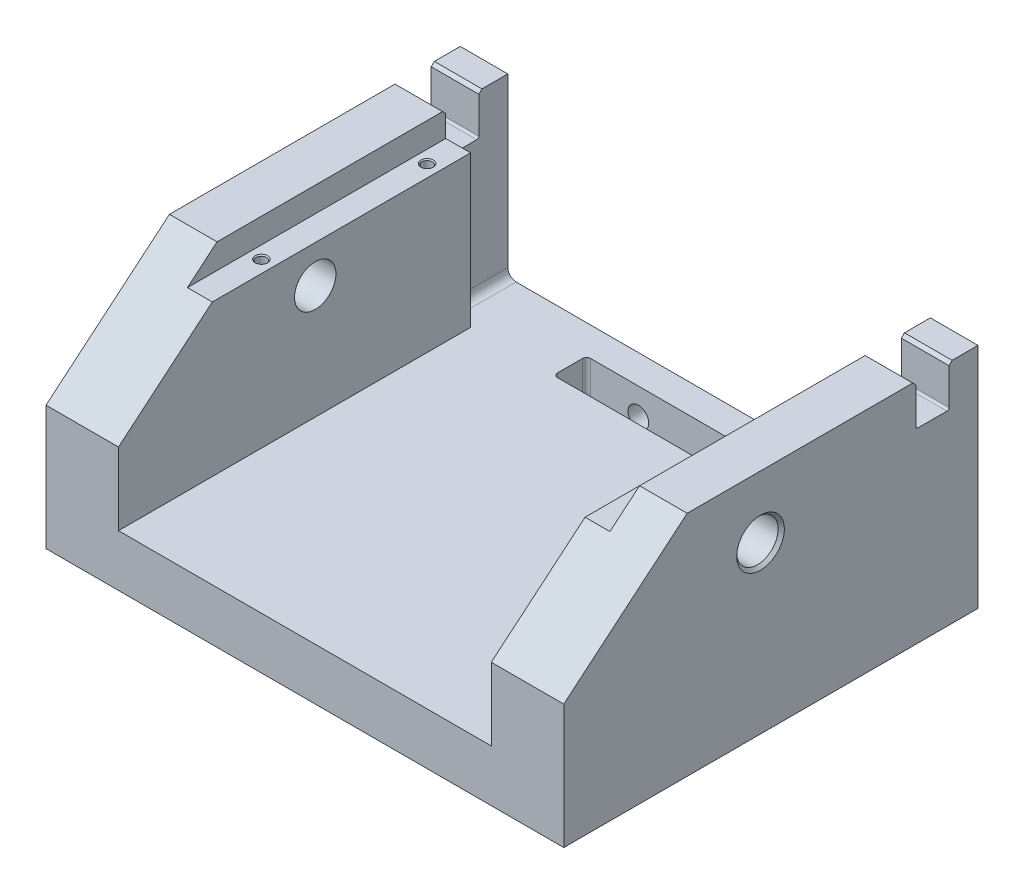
ISO-10303-21;
HEADER;
FILE_DESCRIPTION(('STEP AP214'),'2;1');
FILE_NAME('part.step','',(''),(''),'','','');
FILE_SCHEMA(('AUTOMOTIVE_DESIGN { 1 0 10303 214 1 1 1 1 }'));
ENDSEC;
DATA;
#1=APPLICATION_CONTEXT('core data for automotive mechanical design processes');
#2=APPLICATION_PROTOCOL_DEFINITION('international standard','automotive_design',2000,#1);
#3=PRODUCT_CONTEXT('',#1,'mechanical');
#4=PRODUCT('Part','Part','',(#3));
#5=PRODUCT_RELATED_PRODUCT_CATEGORY('part','',(#4));
#6=PRODUCT_DEFINITION_FORMATION('','',#4);
#7=PRODUCT_DEFINITION_CONTEXT('part definition',#1,'design');
#8=PRODUCT_DEFINITION('design','',#6,#7);
#9=PRODUCT_DEFINITION_SHAPE('','',#8);
#10=(LENGTH_UNIT() NAMED_UNIT(*) SI_UNIT(.MILLI.,.METRE.));
#11=(NAMED_UNIT(*) PLANE_ANGLE_UNIT() SI_UNIT($,.RADIAN.));
#12=(NAMED_UNIT(*) SI_UNIT($,.STERADIAN.) SOLID_ANGLE_UNIT());
#13=UNCERTAINTY_MEASURE_WITH_UNIT(LENGTH_MEASURE(1.E-05),#10,'distance_accuracy_value','');
#14=(GEOMETRIC_REPRESENTATION_CONTEXT(3) GLOBAL_UNCERTAINTY_ASSIGNED_CONTEXT((#13)) GLOBAL_UNIT_ASSIGNED_CONTEXT((#10,
#11,#12)) REPRESENTATION_CONTEXT('',''));
#15=CARTESIAN_POINT('',(0.,0.,0.));
#16=DIRECTION('',(0.,0.,1.));
#17=DIRECTION('',(1.,0.,0.));
#18=AXIS2_PLACEMENT_3D('',#15,#16,#17);
#19=CARTESIAN_POINT('',(90.,110.,100.));
#20=DIRECTION('',(0.,-1.,0.));
#21=DIRECTION('',(0.,0.,-1.));
#22=AXIS2_PLACEMENT_3D('',#19,#20,#21);
#23=PLANE('',#22);
#24=DIRECTION('',(0.,0.,-1.));
#25=VECTOR('',#24,1.);
#26=CARTESIAN_POINT('',(125.,110.,100.));
#27=LINE('',#26,#25);
#28=CARTESIAN_POINT('',(125.,110.,40.4123203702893));
#29=VERTEX_POINT('',#28);
#30=CARTESIAN_POINT('',(125.,110.,-68.4999999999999));
#31=VERTEX_POINT('',#30);
#32=EDGE_CURVE('E407',#29,#31,#27,.T.);
#33=ORIENTED_EDGE('',*,*,#32,.T.);
#34=DIRECTION('',(-1.,0.,0.));
#35=VECTOR('',#34,1.);
#36=CARTESIAN_POINT('',(90.,110.,-68.4999999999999));
#37=LINE('',#36,#35);
#38=CARTESIAN_POINT('',(102.,110.,-68.4999999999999));
#39=VERTEX_POINT('',#38);
#40=EDGE_CURVE('E579',#31,#39,#37,.T.);
#41=ORIENTED_EDGE('',*,*,#40,.T.);
#42=DIRECTION('',(0.,0.,1.));
#43=VECTOR('',#42,1.);
#44=CARTESIAN_POINT('',(102.,110.,-100.));
#45=LINE('',#44,#43);
#46=CARTESIAN_POINT('',(102.,110.,40.4123203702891));
#47=VERTEX_POINT('',#46);
#48=EDGE_CURVE('E347',#39,#47,#45,.T.);
#49=ORIENTED_EDGE('',*,*,#48,.T.);
#50=DIRECTION('',(-1.,0.,0.));
#51=VECTOR('',#50,1.);
#52=CARTESIAN_POINT('',(579.407771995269,110.,40.4123203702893));
#53=LINE('',#52,#51);
#54=EDGE_CURVE('E358',#29,#47,#53,.T.);
#55=ORIENTED_EDGE('',*,*,#54,.F.);
#56=EDGE_LOOP('',(#33,#41,#49,#55));
#57=FACE_BOUND('',#56,.T.);
#58=ADVANCED_FACE('F43',(#57),#23,.F.);
#59=CARTESIAN_POINT('',(102.,110.,-100.));
#60=DIRECTION('',(1.,0.,0.));
#61=DIRECTION('',(0.,0.,-1.));
#62=AXIS2_PLACEMENT_3D('',#59,#60,#61);
#63=PLANE('',#62);
#64=ORIENTED_EDGE('',*,*,#48,.F.);
#65=DIRECTION('',(0.,0.707106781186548,0.707106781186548));
#66=VECTOR('',#65,1.);
#67=CARTESIAN_POINT('',(102.,108.5,-70.));
#68=LINE('',#67,#66);
#69=CARTESIAN_POINT('',(102.,108.5,-69.9999999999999));
#70=VERTEX_POINT('',#69);
#71=EDGE_CURVE('E326',#39,#70,#68,.F.);
#72=ORIENTED_EDGE('',*,*,#71,.T.);
#73=DIRECTION('',(0.,1.,0.));
#74=VECTOR('',#73,1.);
#75=CARTESIAN_POINT('',(102.,90.,-69.9999999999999));
#76=LINE('',#75,#74);
#77=CARTESIAN_POINT('',(102.,98.,-69.9999999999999));
#78=VERTEX_POINT('',#77);
#79=EDGE_CURVE('E317',#78,#70,#76,.T.);
#80=ORIENTED_EDGE('',*,*,#79,.F.);
#81=DIRECTION('',(0.,0.,1.));
#82=VECTOR('',#81,1.);
#83=CARTESIAN_POINT('',(102.,98.,-100.));
#84=LINE('',#83,#82);
#85=CARTESIAN_POINT('',(102.,98.,54.7133634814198));
#86=VERTEX_POINT('',#85);
#87=EDGE_CURVE('E323',#78,#86,#84,.T.);
#88=ORIENTED_EDGE('',*,*,#87,.T.);
#89=DIRECTION('',(0.,0.642787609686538,-0.766044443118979));
#90=VECTOR('',#89,1.);
#91=CARTESIAN_POINT('',(102.,60.,100.));
#92=LINE('',#91,#90);
#93=EDGE_CURVE('E425',#86,#47,#92,.T.);
#94=ORIENTED_EDGE('',*,*,#93,.T.);
#95=EDGE_LOOP('',(#64,#72,#80,#88,#94));
#96=FACE_BOUND('',#95,.T.);
#97=ADVANCED_FACE('F320',(#96),#63,.F.);
#98=CARTESIAN_POINT('',(-125.,110.,100.));
#99=DIRECTION('',(0.,-1.,0.));
#100=DIRECTION('',(0.,0.,-1.));
#101=AXIS2_PLACEMENT_3D('',#98,#99,#100);
#102=PLANE('',#101);
#103=DIRECTION('',(0.,0.,1.));
#104=VECTOR('',#103,1.);
#105=CARTESIAN_POINT('',(-102.,110.,-100.));
#106=LINE('',#105,#104);
#107=CARTESIAN_POINT('',(-102.,110.,-68.5));
#108=VERTEX_POINT('',#107);
#109=CARTESIAN_POINT('',(-102.,110.,40.4123203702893));
#110=VERTEX_POINT('',#109);
#111=EDGE_CURVE('E708',#108,#110,#106,.T.);
#112=ORIENTED_EDGE('',*,*,#111,.F.);
#113=DIRECTION('',(-1.,0.,0.));
#114=VECTOR('',#113,1.);
#115=CARTESIAN_POINT('',(-125.,110.,-68.5));
#116=LINE('',#115,#114);
#117=CARTESIAN_POINT('',(-125.,110.,-68.5));
#118=VERTEX_POINT('',#117);
#119=EDGE_CURVE('E587',#108,#118,#116,.T.);
#120=ORIENTED_EDGE('',*,*,#119,.T.);
#121=DIRECTION('',(0.,0.,-1.));
#122=VECTOR('',#121,1.);
#123=CARTESIAN_POINT('',(-125.,110.,100.));
#124=LINE('',#123,#122);
#125=CARTESIAN_POINT('',(-125.,110.,40.4123203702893));
#126=VERTEX_POINT('',#125);
#127=EDGE_CURVE('E417',#126,#118,#124,.T.);
#128=ORIENTED_EDGE('',*,*,#127,.F.);
#129=EDGE_CURVE('E356',#110,#126,#53,.T.);
#130=ORIENTED_EDGE('',*,*,#129,.F.);
#131=EDGE_LOOP('',(#112,#120,#128,#130));
#132=FACE_BOUND('',#131,.T.);
#133=ADVANCED_FACE('F626',(#132),#102,.F.);
#134=CARTESIAN_POINT('',(-102.,110.,-100.));
#135=DIRECTION('',(-1.,0.,0.));
#136=DIRECTION('',(0.,0.,1.));
#137=AXIS2_PLACEMENT_3D('',#134,#135,#136);
#138=PLANE('',#137);
#139=DIRECTION('',(0.,1.,0.));
#140=VECTOR('',#139,1.);
#141=CARTESIAN_POINT('',(-102.,90.,-70.));
#142=LINE('',#141,#140);
#143=CARTESIAN_POINT('',(-102.,98.,-70.));
#144=VERTEX_POINT('',#143);
#145=CARTESIAN_POINT('',(-102.,108.5,-70.));
#146=VERTEX_POINT('',#145);
#147=EDGE_CURVE('E679',#144,#146,#142,.T.);
#148=ORIENTED_EDGE('',*,*,#147,.T.);
#149=DIRECTION('',(0.,-0.707106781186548,-0.707106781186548));
#150=VECTOR('',#149,1.);
#151=CARTESIAN_POINT('',(-102.,108.5,-70.));
#152=LINE('',#151,#150);
#153=EDGE_CURVE('E585',#146,#108,#152,.F.);
#154=ORIENTED_EDGE('',*,*,#153,.T.);
#155=ORIENTED_EDGE('',*,*,#111,.T.);
#156=DIRECTION('',(0.,-0.642787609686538,0.766044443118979));
#157=VECTOR('',#156,1.);
#158=CARTESIAN_POINT('',(-102.,60.,100.));
#159=LINE('',#158,#157);
#160=CARTESIAN_POINT('',(-102.,98.,54.7133634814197));
#161=VERTEX_POINT('',#160);
#162=EDGE_CURVE('E427',#110,#161,#159,.T.);
#163=ORIENTED_EDGE('',*,*,#162,.T.);
#164=DIRECTION('',(0.,0.,1.));
#165=VECTOR('',#164,1.);
#166=CARTESIAN_POINT('',(-102.,98.,-100.));
#167=LINE('',#166,#165);
#168=EDGE_CURVE('E711',#144,#161,#167,.T.);
#169=ORIENTED_EDGE('',*,*,#168,.F.);
#170=EDGE_LOOP('',(#148,#154,#155,#163,#169));
#171=FACE_BOUND('',#170,.T.);
#172=ADVANCED_FACE('F914',(#171),#138,.F.);
#173=CARTESIAN_POINT('',(-125.,110.,-87.5));
#174=VERTEX_POINT('',#173);
#175=CARTESIAN_POINT('',(-125.,110.,-100.));
#176=VERTEX_POINT('',#175);
#177=EDGE_CURVE('E416',#174,#176,#124,.T.);
#178=ORIENTED_EDGE('',*,*,#177,.F.);
#179=DIRECTION('',(1.,0.,0.));
#180=VECTOR('',#179,1.);
#181=CARTESIAN_POINT('',(-125.,110.,-87.5));
#182=LINE('',#181,#180);
#183=CARTESIAN_POINT('',(-102.,110.,-87.5));
#184=VERTEX_POINT('',#183);
#185=EDGE_CURVE('E58',#174,#184,#182,.T.);
#186=ORIENTED_EDGE('',*,*,#185,.T.);
#187=CARTESIAN_POINT('',(-102.,110.,-100.));
#188=VERTEX_POINT('',#187);
#189=EDGE_CURVE('E713',#188,#184,#106,.T.);
#190=ORIENTED_EDGE('',*,*,#189,.F.);
#191=DIRECTION('',(-1.,0.,0.));
#192=VECTOR('',#191,1.);
#193=CARTESIAN_POINT('',(-125.,110.,-100.));
#194=LINE('',#193,#192);
#195=EDGE_CURVE('E370',#188,#176,#194,.T.);
#196=ORIENTED_EDGE('',*,*,#195,.T.);
#197=EDGE_LOOP('',(#178,#186,#190,#196));
#198=FACE_BOUND('',#197,.T.);
#199=ADVANCED_FACE('F1040',(#198),#102,.F.);
#200=CARTESIAN_POINT('',(-125.,0.,100.));
#201=DIRECTION('',(1.,0.,0.));
#202=DIRECTION('',(0.,1.,0.));
#203=AXIS2_PLACEMENT_3D('',#200,#201,#202);
#204=PLANE('',#203);
#205=CARTESIAN_POINT('',(-125.,80.,5.));
#206=DIRECTION('',(1.,0.,0.));
#207=DIRECTION('',(0.,1.,0.));
#208=AXIS2_PLACEMENT_3D('',#205,#206,#207);
#209=CIRCLE('',#208,11.5);
#210=CARTESIAN_POINT('',(-125.,91.4999999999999,5.));
#211=VERTEX_POINT('',#210);
#212=EDGE_CURVE('E598',#211,#211,#209,.T.);
#213=ORIENTED_EDGE('',*,*,#212,.T.);
#214=EDGE_LOOP('',(#213));
#215=FACE_BOUND('',#214,.T.);
#216=ORIENTED_EDGE('',*,*,#127,.T.);
#217=DIRECTION('',(0.,0.707106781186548,0.707106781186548));
#218=VECTOR('',#217,1.);
#219=CARTESIAN_POINT('',(-125.,108.5,-70.));
#220=LINE('',#219,#218);
#221=CARTESIAN_POINT('',(-125.,108.5,-70.));
#222=VERTEX_POINT('',#221);
#223=EDGE_CURVE('E591',#118,#222,#220,.F.);
#224=ORIENTED_EDGE('',*,*,#223,.T.);
#225=DIRECTION('',(0.,1.,0.));
#226=VECTOR('',#225,1.);
#227=CARTESIAN_POINT('',(-125.,90.,-70.));
#228=LINE('',#227,#226);
#229=CARTESIAN_POINT('',(-125.,91.,-70.));
#230=VERTEX_POINT('',#229);
#231=EDGE_CURVE('E682',#230,#222,#228,.T.);
#232=ORIENTED_EDGE('',*,*,#231,.F.);
#233=CARTESIAN_POINT('',(-125.,91.,-71.));
#234=DIRECTION('',(1.,0.,0.));
#235=DIRECTION('',(0.,1.,0.));
#236=AXIS2_PLACEMENT_3D('',#233,#234,#235);
#237=CIRCLE('',#236,1.);
#238=CARTESIAN_POINT('',(-125.,90.,-71.));
#239=VERTEX_POINT('',#238);
#240=EDGE_CURVE('E497',#230,#239,#237,.T.);
#241=ORIENTED_EDGE('',*,*,#240,.T.);
#242=DIRECTION('',(0.,0.,1.));
#243=VECTOR('',#242,1.);
#244=CARTESIAN_POINT('',(-125.,90.,-70.));
#245=LINE('',#244,#243);
#246=CARTESIAN_POINT('',(-125.,90.,-85.));
#247=VERTEX_POINT('',#246);
#248=EDGE_CURVE('E675',#247,#239,#245,.T.);
#249=ORIENTED_EDGE('',*,*,#248,.F.);
#250=CARTESIAN_POINT('',(-125.,91.,-85.));
#251=DIRECTION('',(1.,0.,0.));
#252=DIRECTION('',(0.,1.,0.));
#253=AXIS2_PLACEMENT_3D('',#250,#251,#252);
#254=CIRCLE('',#253,1.);
#255=CARTESIAN_POINT('',(-125.,91.,-86.));
#256=VERTEX_POINT('',#255);
#257=EDGE_CURVE('E499',#247,#256,#254,.T.);
#258=ORIENTED_EDGE('',*,*,#257,.T.);
#259=DIRECTION('',(0.,1.,0.));
#260=VECTOR('',#259,1.);
#261=CARTESIAN_POINT('',(-125.,90.,-86.));
#262=LINE('',#261,#260);
#263=CARTESIAN_POINT('',(-125.,108.5,-86.));
#264=VERTEX_POINT('',#263);
#265=EDGE_CURVE('E685',#256,#264,#262,.T.);
#266=ORIENTED_EDGE('',*,*,#265,.T.);
#267=DIRECTION('',(0.,-0.707106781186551,0.707106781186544));
#268=VECTOR('',#267,1.);
#269=CARTESIAN_POINT('',(-125.,108.5,-86.));
#270=LINE('',#269,#268);
#271=EDGE_CURVE('E589',#264,#174,#270,.F.);
#272=ORIENTED_EDGE('',*,*,#271,.T.);
#273=ORIENTED_EDGE('',*,*,#177,.T.);
#274=DIRECTION('',(0.,-1.,0.));
#275=VECTOR('',#274,1.);
#276=CARTESIAN_POINT('',(-125.,0.,-100.));
#277=LINE('',#276,#275);
#278=CARTESIAN_POINT('',(-125.,0.,-100.));
#279=VERTEX_POINT('',#278);
#280=EDGE_CURVE('E387',#176,#279,#277,.T.);
#281=ORIENTED_EDGE('',*,*,#280,.T.);
#282=DIRECTION('',(0.,0.,-1.));
#283=VECTOR('',#282,1.);
#284=CARTESIAN_POINT('',(-125.,0.,100.));
#285=LINE('',#284,#283);
#286=CARTESIAN_POINT('',(-125.,0.,100.));
#287=VERTEX_POINT('',#286);
#288=EDGE_CURVE('E413',#287,#279,#285,.T.);
#289=ORIENTED_EDGE('',*,*,#288,.F.);
#290=DIRECTION('',(0.,-1.,0.));
#291=VECTOR('',#290,1.);
#292=CARTESIAN_POINT('',(-125.,0.,100.));
#293=LINE('',#292,#291);
#294=CARTESIAN_POINT('',(-125.,60.,100.));
#295=VERTEX_POINT('',#294);
#296=EDGE_CURVE('E371',#295,#287,#293,.T.);
#297=ORIENTED_EDGE('',*,*,#296,.F.);
#298=DIRECTION('',(0.,-0.642787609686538,0.766044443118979));
#299=VECTOR('',#298,1.);
#300=CARTESIAN_POINT('',(-125.,35.209445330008,129.544232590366));
#301=LINE('',#300,#299);
#302=EDGE_CURVE('E367',#126,#295,#301,.T.);
#303=ORIENTED_EDGE('',*,*,#302,.F.);
#304=EDGE_LOOP('',(#216,#224,#232,#241,#249,#258,#266,#272,#273,#281,#289,#297,#303));
#305=FACE_BOUND('',#304,.T.);
#306=ADVANCED_FACE('F643',(#215,#305),#204,.F.);
#307=CARTESIAN_POINT('',(125.,110.,100.));
#308=DIRECTION('',(-1.,0.,0.));
#309=DIRECTION('',(0.,-1.,0.));
#310=AXIS2_PLACEMENT_3D('',#307,#308,#309);
#311=PLANE('',#310);
#312=CARTESIAN_POINT('',(125.,80.,5.));
#313=DIRECTION('',(-1.,0.,0.));
#314=DIRECTION('',(0.,-1.,0.));
#315=AXIS2_PLACEMENT_3D('',#312,#313,#314);
#316=CIRCLE('',#315,11.5);
#317=CARTESIAN_POINT('',(125.,68.5,5.));
#318=VERTEX_POINT('',#317);
#319=EDGE_CURVE('E11',#318,#318,#316,.T.);
#320=ORIENTED_EDGE('',*,*,#319,.T.);
#321=EDGE_LOOP('',(#320));
#322=FACE_BOUND('',#321,.T.);
#323=CARTESIAN_POINT('',(125.,110.,-87.4999999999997));
#324=VERTEX_POINT('',#323);
#325=CARTESIAN_POINT('',(125.,110.,-100.));
#326=VERTEX_POINT('',#325);
#327=EDGE_CURVE('E406',#324,#326,#27,.T.);
#328=ORIENTED_EDGE('',*,*,#327,.F.);
#329=DIRECTION('',(0.,0.707106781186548,-0.707106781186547));
#330=VECTOR('',#329,1.);
#331=CARTESIAN_POINT('',(125.,108.5,-85.9999999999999));
#332=LINE('',#331,#330);
#333=CARTESIAN_POINT('',(125.,108.5,-85.9999999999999));
#334=VERTEX_POINT('',#333);
#335=EDGE_CURVE('E575',#324,#334,#332,.F.);
#336=ORIENTED_EDGE('',*,*,#335,.T.);
#337=DIRECTION('',(0.,1.,0.));
#338=VECTOR('',#337,1.);
#339=CARTESIAN_POINT('',(125.,90.,-85.9999999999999));
#340=LINE('',#339,#338);
#341=CARTESIAN_POINT('',(125.,91.,-85.9999999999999));
#342=VERTEX_POINT('',#341);
#343=EDGE_CURVE('E659',#342,#334,#340,.T.);
#344=ORIENTED_EDGE('',*,*,#343,.F.);
#345=CARTESIAN_POINT('',(125.,91.,-84.9999999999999));
#346=DIRECTION('',(-1.,0.,0.));
#347=DIRECTION('',(0.,-1.,0.));
#348=AXIS2_PLACEMENT_3D('',#345,#346,#347);
#349=CIRCLE('',#348,1.);
#350=CARTESIAN_POINT('',(125.,90.,-84.9999999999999));
#351=VERTEX_POINT('',#350);
#352=EDGE_CURVE('E492',#342,#351,#349,.T.);
#353=ORIENTED_EDGE('',*,*,#352,.T.);
#354=DIRECTION('',(0.,0.,-1.));
#355=VECTOR('',#354,1.);
#356=CARTESIAN_POINT('',(125.,90.,-69.9999999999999));
#357=LINE('',#356,#355);
#358=CARTESIAN_POINT('',(125.,90.,-71.));
#359=VERTEX_POINT('',#358);
#360=EDGE_CURVE('E744',#359,#351,#357,.T.);
#361=ORIENTED_EDGE('',*,*,#360,.F.);
#362=CARTESIAN_POINT('',(125.,91.,-71.));
#363=DIRECTION('',(-1.,0.,0.));
#364=DIRECTION('',(0.,-1.,0.));
#365=AXIS2_PLACEMENT_3D('',#362,#363,#364);
#366=CIRCLE('',#365,1.);
#367=CARTESIAN_POINT('',(125.,91.,-69.9999999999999));
#368=VERTEX_POINT('',#367);
#369=EDGE_CURVE('E486',#359,#368,#366,.T.);
#370=ORIENTED_EDGE('',*,*,#369,.T.);
#371=DIRECTION('',(0.,1.,0.));
#372=VECTOR('',#371,1.);
#373=CARTESIAN_POINT('',(125.,90.,-69.9999999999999));
#374=LINE('',#373,#372);
#375=CARTESIAN_POINT('',(125.,108.5,-69.9999999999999));
#376=VERTEX_POINT('',#375);
#377=EDGE_CURVE('E666',#368,#376,#374,.T.);
#378=ORIENTED_EDGE('',*,*,#377,.T.);
#379=DIRECTION('',(0.,-0.707106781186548,-0.707106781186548));
#380=VECTOR('',#379,1.);
#381=CARTESIAN_POINT('',(125.,108.5,-70.));
#382=LINE('',#381,#380);
#383=EDGE_CURVE('E573',#376,#31,#382,.F.);
#384=ORIENTED_EDGE('',*,*,#383,.T.);
#385=ORIENTED_EDGE('',*,*,#32,.F.);
#386=DIRECTION('',(0.,0.642787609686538,-0.766044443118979));
#387=VECTOR('',#386,1.);
#388=CARTESIAN_POINT('',(125.,80.6587955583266,75.3798061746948));
#389=LINE('',#388,#387);
#390=CARTESIAN_POINT('',(125.,60.,100.));
#391=VERTEX_POINT('',#390);
#392=EDGE_CURVE('E364',#391,#29,#389,.T.);
#393=ORIENTED_EDGE('',*,*,#392,.F.);
#394=DIRECTION('',(0.,1.,0.));
#395=VECTOR('',#394,1.);
#396=CARTESIAN_POINT('',(125.,110.,100.));
#397=LINE('',#396,#395);
#398=CARTESIAN_POINT('',(125.,0.,100.));
#399=VERTEX_POINT('',#398);
#400=EDGE_CURVE('E376',#399,#391,#397,.T.);
#401=ORIENTED_EDGE('',*,*,#400,.F.);
#402=DIRECTION('',(0.,0.,-1.));
#403=VECTOR('',#402,1.);
#404=CARTESIAN_POINT('',(125.,0.,100.));
#405=LINE('',#404,#403);
#406=CARTESIAN_POINT('',(125.,0.,-100.));
#407=VERTEX_POINT('',#406);
#408=EDGE_CURVE('E410',#399,#407,#405,.T.);
#409=ORIENTED_EDGE('',*,*,#408,.T.);
#410=DIRECTION('',(0.,1.,0.));
#411=VECTOR('',#410,1.);
#412=CARTESIAN_POINT('',(125.,110.,-100.));
#413=LINE('',#412,#411);
#414=EDGE_CURVE('E392',#407,#326,#413,.T.);
#415=ORIENTED_EDGE('',*,*,#414,.T.);
#416=EDGE_LOOP('',(#328,#336,#344,#353,#361,#370,#378,#384,#385,#393,#401,#409,#415));
#417=FACE_BOUND('',#416,.T.);
#418=ADVANCED_FACE('F633',(#322,#417),#311,.F.);
#419=CARTESIAN_POINT('',(102.,110.,-100.));
#420=VERTEX_POINT('',#419);
#421=CARTESIAN_POINT('',(102.,110.,-87.4999999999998));
#422=VERTEX_POINT('',#421);
#423=EDGE_CURVE('E350',#420,#422,#45,.T.);
#424=ORIENTED_EDGE('',*,*,#423,.T.);
#425=DIRECTION('',(1.,0.,0.));
#426=VECTOR('',#425,1.);
#427=CARTESIAN_POINT('',(90.0000000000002,110.,-87.4999999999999));
#428=LINE('',#427,#426);
#429=EDGE_CURVE('E571',#422,#324,#428,.T.);
#430=ORIENTED_EDGE('',*,*,#429,.T.);
#431=ORIENTED_EDGE('',*,*,#327,.T.);
#432=DIRECTION('',(-1.,0.,0.));
#433=VECTOR('',#432,1.);
#434=CARTESIAN_POINT('',(90.,110.,-100.));
#435=LINE('',#434,#433);
#436=EDGE_CURVE('E395',#326,#420,#435,.T.);
#437=ORIENTED_EDGE('',*,*,#436,.T.);
#438=EDGE_LOOP('',(#424,#430,#431,#437));
#439=FACE_BOUND('',#438,.T.);
#440=ADVANCED_FACE('F621',(#439),#23,.F.);
#441=CARTESIAN_POINT('',(90.,25.,100.));
#442=DIRECTION('',(1.,0.,0.));
#443=DIRECTION('',(0.,1.,0.));
#444=AXIS2_PLACEMENT_3D('',#441,#442,#443);
#445=PLANE('',#444);
#446=CARTESIAN_POINT('',(90.,80.,5.));
#447=DIRECTION('',(1.,0.,0.));
#448=DIRECTION('',(0.,1.,0.));
#449=AXIS2_PLACEMENT_3D('',#446,#447,#448);
#450=CIRCLE('',#449,10.);
#451=CARTESIAN_POINT('',(90.,90.,5.));
#452=VERTEX_POINT('',#451);
#453=EDGE_CURVE('E566',#452,#452,#450,.T.);
#454=ORIENTED_EDGE('',*,*,#453,.T.);
#455=EDGE_LOOP('',(#454));
#456=FACE_BOUND('',#455,.T.);
#457=DIRECTION('',(0.,0.,1.));
#458=VECTOR('',#457,1.);
#459=CARTESIAN_POINT('',(90.,98.,-100.));
#460=LINE('',#459,#458);
#461=CARTESIAN_POINT('',(90.,98.,-70.));
#462=VERTEX_POINT('',#461);
#463=CARTESIAN_POINT('',(90.,98.,54.7133634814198));
#464=VERTEX_POINT('',#463);
#465=EDGE_CURVE('E348',#462,#464,#460,.T.);
#466=ORIENTED_EDGE('',*,*,#465,.F.);
#467=DIRECTION('',(0.,1.,0.));
#468=VECTOR('',#467,1.);
#469=CARTESIAN_POINT('',(90.,-7.31098884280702,-70.));
#470=LINE('',#469,#468);
#471=CARTESIAN_POINT('',(90.,25.,-70.));
#472=VERTEX_POINT('',#471);
#473=EDGE_CURVE('E337',#472,#462,#470,.T.);
#474=ORIENTED_EDGE('',*,*,#473,.F.);
#475=DIRECTION('',(0.,0.,-1.));
#476=VECTOR('',#475,1.);
#477=CARTESIAN_POINT('',(90.,25.,100.));
#478=LINE('',#477,#476);
#479=CARTESIAN_POINT('',(90.,25.,100.));
#480=VERTEX_POINT('',#479);
#481=EDGE_CURVE('E403',#480,#472,#478,.T.);
#482=ORIENTED_EDGE('',*,*,#481,.F.);
#483=DIRECTION('',(0.,-1.,0.));
#484=VECTOR('',#483,1.);
#485=CARTESIAN_POINT('',(90.,25.,100.));
#486=LINE('',#485,#484);
#487=CARTESIAN_POINT('',(90.,60.,100.));
#488=VERTEX_POINT('',#487);
#489=EDGE_CURVE('E378',#488,#480,#486,.T.);
#490=ORIENTED_EDGE('',*,*,#489,.F.);
#491=DIRECTION('',(0.,-0.642787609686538,0.766044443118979));
#492=VECTOR('',#491,1.);
#493=CARTESIAN_POINT('',(90.,45.5388431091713,117.234135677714));
#494=LINE('',#493,#492);
#495=EDGE_CURVE('E362',#464,#488,#494,.T.);
#496=ORIENTED_EDGE('',*,*,#495,.F.);
#497=EDGE_LOOP('',(#466,#474,#482,#490,#496));
#498=FACE_BOUND('',#497,.T.);
#499=ADVANCED_FACE('F632',(#456,#498),#445,.F.);
#500=CARTESIAN_POINT('',(-90.,110.,100.));
#501=DIRECTION('',(-1.,0.,0.));
#502=DIRECTION('',(0.,-1.,0.));
#503=AXIS2_PLACEMENT_3D('',#500,#501,#502);
#504=PLANE('',#503);
#505=CARTESIAN_POINT('',(-90.,80.,5.));
#506=DIRECTION('',(-1.,0.,0.));
#507=DIRECTION('',(0.,-1.,0.));
#508=AXIS2_PLACEMENT_3D('',#505,#506,#507);
#509=CIRCLE('',#508,10.);
#510=CARTESIAN_POINT('',(-90.,70.,5.));
#511=VERTEX_POINT('',#510);
#512=EDGE_CURVE('E563',#511,#511,#509,.T.);
#513=ORIENTED_EDGE('',*,*,#512,.T.);
#514=EDGE_LOOP('',(#513));
#515=FACE_BOUND('',#514,.T.);
#516=DIRECTION('',(0.,0.,-1.));
#517=VECTOR('',#516,1.);
#518=CARTESIAN_POINT('',(-90.,25.,100.));
#519=LINE('',#518,#517);
#520=CARTESIAN_POINT('',(-90.,25.,100.));
#521=VERTEX_POINT('',#520);
#522=CARTESIAN_POINT('',(-90.,25.,-70.));
#523=VERTEX_POINT('',#522);
#524=EDGE_CURVE('E384',#521,#523,#519,.T.);
#525=ORIENTED_EDGE('',*,*,#524,.T.);
#526=DIRECTION('',(0.,1.,0.));
#527=VECTOR('',#526,1.);
#528=CARTESIAN_POINT('',(-90.,-7.31098884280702,-70.));
#529=LINE('',#528,#527);
#530=CARTESIAN_POINT('',(-90.,98.,-70.));
#531=VERTEX_POINT('',#530);
#532=EDGE_CURVE('E698',#523,#531,#529,.T.);
#533=ORIENTED_EDGE('',*,*,#532,.T.);
#534=DIRECTION('',(0.,0.,1.));
#535=VECTOR('',#534,1.);
#536=CARTESIAN_POINT('',(-90.,98.,-100.));
#537=LINE('',#536,#535);
#538=CARTESIAN_POINT('',(-90.,98.,54.7133634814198));
#539=VERTEX_POINT('',#538);
#540=EDGE_CURVE('E709',#531,#539,#537,.T.);
#541=ORIENTED_EDGE('',*,*,#540,.T.);
#542=DIRECTION('',(0.,0.642787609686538,-0.766044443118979));
#543=VECTOR('',#542,1.);
#544=CARTESIAN_POINT('',(-90.,80.6587955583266,75.3798061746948));
#545=LINE('',#544,#543);
#546=CARTESIAN_POINT('',(-90.,60.,100.));
#547=VERTEX_POINT('',#546);
#548=EDGE_CURVE('E359',#547,#539,#545,.T.);
#549=ORIENTED_EDGE('',*,*,#548,.F.);
#550=DIRECTION('',(0.,1.,0.));
#551=VECTOR('',#550,1.);
#552=CARTESIAN_POINT('',(-90.,110.,100.));
#553=LINE('',#552,#551);
#554=EDGE_CURVE('E382',#521,#547,#553,.T.);
#555=ORIENTED_EDGE('',*,*,#554,.F.);
#556=EDGE_LOOP('',(#525,#533,#541,#549,#555));
#557=FACE_BOUND('',#556,.T.);
#558=ADVANCED_FACE('F640',(#515,#557),#504,.F.);
#559=CARTESIAN_POINT('',(0.,0.,100.));
#560=DIRECTION('',(0.,0.,-1.));
#561=DIRECTION('',(-1.,0.,0.));
#562=AXIS2_PLACEMENT_3D('',#559,#560,#561);
#563=PLANE('',#562);
#564=DIRECTION('',(1.,0.,0.));
#565=VECTOR('',#564,1.);
#566=CARTESIAN_POINT('',(0.,60.,100.));
#567=LINE('',#566,#565);
#568=EDGE_CURVE('E423',#295,#547,#567,.T.);
#569=ORIENTED_EDGE('',*,*,#568,.F.);
#570=ORIENTED_EDGE('',*,*,#296,.T.);
#571=DIRECTION('',(1.,0.,0.));
#572=VECTOR('',#571,1.);
#573=CARTESIAN_POINT('',(125.,0.,100.));
#574=LINE('',#573,#572);
#575=EDGE_CURVE('E373',#287,#399,#574,.T.);
#576=ORIENTED_EDGE('',*,*,#575,.T.);
#577=ORIENTED_EDGE('',*,*,#400,.T.);
#578=EDGE_CURVE('E420',#488,#391,#567,.T.);
#579=ORIENTED_EDGE('',*,*,#578,.F.);
#580=ORIENTED_EDGE('',*,*,#489,.T.);
#581=DIRECTION('',(-1.,0.,0.));
#582=VECTOR('',#581,1.);
#583=CARTESIAN_POINT('',(-90.,25.,100.));
#584=LINE('',#583,#582);
#585=EDGE_CURVE('E380',#480,#521,#584,.T.);
#586=ORIENTED_EDGE('',*,*,#585,.T.);
#587=ORIENTED_EDGE('',*,*,#554,.T.);
#588=EDGE_LOOP('',(#569,#570,#576,#577,#579,#580,#586,#587));
#589=FACE_BOUND('',#588,.T.);
#590=ADVANCED_FACE('F923',(#589),#563,.F.);
#591=CARTESIAN_POINT('',(125.,0.,100.));
#592=DIRECTION('',(0.,1.,0.));
#593=DIRECTION('',(0.,0.,1.));
#594=AXIS2_PLACEMENT_3D('',#591,#592,#593);
#595=PLANE('',#594);
#596=DIRECTION('',(0.,0.,-1.));
#597=VECTOR('',#596,1.);
#598=CARTESIAN_POINT('',(50.,0.,-86.));
#599=LINE('',#598,#597);
#600=CARTESIAN_POINT('',(50.,0.,-72.));
#601=VERTEX_POINT('',#600);
#602=CARTESIAN_POINT('',(50.,0.,-84.));
#603=VERTEX_POINT('',#602);
#604=EDGE_CURVE('E776',#601,#603,#599,.T.);
#605=ORIENTED_EDGE('',*,*,#604,.T.);
#606=CARTESIAN_POINT('',(48.,0.,-84.));
#607=DIRECTION('',(0.,1.,0.));
#608=DIRECTION('',(0.,0.,1.));
#609=AXIS2_PLACEMENT_3D('',#606,#607,#608);
#610=CIRCLE('',#609,2.);
#611=CARTESIAN_POINT('',(48.,0.,-86.));
#612=VERTEX_POINT('',#611);
#613=EDGE_CURVE('E540',#603,#612,#610,.T.);
#614=ORIENTED_EDGE('',*,*,#613,.T.);
#615=DIRECTION('',(-1.,0.,0.));
#616=VECTOR('',#615,1.);
#617=CARTESIAN_POINT('',(-50.,0.,-86.));
#618=LINE('',#617,#616);
#619=CARTESIAN_POINT('',(-48.,0.,-86.));
#620=VERTEX_POINT('',#619);
#621=EDGE_CURVE('E755',#612,#620,#618,.T.);
#622=ORIENTED_EDGE('',*,*,#621,.T.);
#623=CARTESIAN_POINT('',(-48.,0.,-84.));
#624=DIRECTION('',(0.,1.,0.));
#625=DIRECTION('',(0.,0.,1.));
#626=AXIS2_PLACEMENT_3D('',#623,#624,#625);
#627=CIRCLE('',#626,2.);
#628=CARTESIAN_POINT('',(-50.,0.,-84.));
#629=VERTEX_POINT('',#628);
#630=EDGE_CURVE('E536',#620,#629,#627,.T.);
#631=ORIENTED_EDGE('',*,*,#630,.T.);
#632=DIRECTION('',(0.,0.,1.));
#633=VECTOR('',#632,1.);
#634=CARTESIAN_POINT('',(-50.,0.,-86.));
#635=LINE('',#634,#633);
#636=CARTESIAN_POINT('',(-50.,0.,-72.));
#637=VERTEX_POINT('',#636);
#638=EDGE_CURVE('E762',#629,#637,#635,.T.);
#639=ORIENTED_EDGE('',*,*,#638,.T.);
#640=CARTESIAN_POINT('',(-48.,0.,-72.));
#641=DIRECTION('',(0.,1.,0.));
#642=DIRECTION('',(0.,0.,1.));
#643=AXIS2_PLACEMENT_3D('',#640,#641,#642);
#644=CIRCLE('',#643,2.);
#645=CARTESIAN_POINT('',(-48.,0.,-70.));
#646=VERTEX_POINT('',#645);
#647=EDGE_CURVE('E531',#637,#646,#644,.T.);
#648=ORIENTED_EDGE('',*,*,#647,.T.);
#649=DIRECTION('',(1.,0.,0.));
#650=VECTOR('',#649,1.);
#651=CARTESIAN_POINT('',(-50.,0.,-70.));
#652=LINE('',#651,#650);
#653=CARTESIAN_POINT('',(48.,0.,-70.));
#654=VERTEX_POINT('',#653);
#655=EDGE_CURVE('E779',#646,#654,#652,.T.);
#656=ORIENTED_EDGE('',*,*,#655,.T.);
#657=CARTESIAN_POINT('',(48.,0.,-72.));
#658=DIRECTION('',(0.,1.,0.));
#659=DIRECTION('',(0.,0.,1.));
#660=AXIS2_PLACEMENT_3D('',#657,#658,#659);
#661=CIRCLE('',#660,2.);
#662=EDGE_CURVE('E527',#654,#601,#661,.T.);
#663=ORIENTED_EDGE('',*,*,#662,.T.);
#664=EDGE_LOOP('',(#605,#614,#622,#631,#639,#648,#656,#663));
#665=FACE_BOUND('',#664,.T.);
#666=DIRECTION('',(1.,0.,0.));
#667=VECTOR('',#666,1.);
#668=CARTESIAN_POINT('',(125.,0.,-100.));
#669=LINE('',#668,#667);
#670=EDGE_CURVE('E389',#279,#407,#669,.T.);
#671=ORIENTED_EDGE('',*,*,#670,.T.);
#672=ORIENTED_EDGE('',*,*,#408,.F.);
#673=ORIENTED_EDGE('',*,*,#575,.F.);
#674=ORIENTED_EDGE('',*,*,#288,.T.);
#675=EDGE_LOOP('',(#671,#672,#673,#674));
#676=FACE_BOUND('',#675,.T.);
#677=ADVANCED_FACE('F926',(#665,#676),#595,.F.);
#678=CARTESIAN_POINT('',(-90.,25.,100.));
#679=DIRECTION('',(0.,-1.,0.));
#680=DIRECTION('',(0.,0.,-1.));
#681=AXIS2_PLACEMENT_3D('',#678,#679,#680);
#682=PLANE('',#681);
#683=DIRECTION('',(1.,0.,0.));
#684=VECTOR('',#683,1.);
#685=CARTESIAN_POINT('',(-50.,25.,-70.));
#686=LINE('',#685,#684);
#687=CARTESIAN_POINT('',(-48.,25.,-70.));
#688=VERTEX_POINT('',#687);
#689=CARTESIAN_POINT('',(48.,25.,-70.));
#690=VERTEX_POINT('',#689);
#691=EDGE_CURVE('E766',#688,#690,#686,.T.);
#692=ORIENTED_EDGE('',*,*,#691,.F.);
#693=CARTESIAN_POINT('',(-48.,25.,-72.));
#694=DIRECTION('',(0.,-1.,0.));
#695=DIRECTION('',(0.,0.,-1.));
#696=AXIS2_PLACEMENT_3D('',#693,#694,#695);
#697=CIRCLE('',#696,2.);
#698=CARTESIAN_POINT('',(-50.,25.,-72.));
#699=VERTEX_POINT('',#698);
#700=EDGE_CURVE('E529',#688,#699,#697,.T.);
#701=ORIENTED_EDGE('',*,*,#700,.T.);
#702=DIRECTION('',(0.,0.,1.));
#703=VECTOR('',#702,1.);
#704=CARTESIAN_POINT('',(-50.,25.,-86.));
#705=LINE('',#704,#703);
#706=CARTESIAN_POINT('',(-50.,25.,-84.));
#707=VERTEX_POINT('',#706);
#708=EDGE_CURVE('E769',#707,#699,#705,.T.);
#709=ORIENTED_EDGE('',*,*,#708,.F.);
#710=CARTESIAN_POINT('',(-48.,25.,-84.));
#711=DIRECTION('',(0.,-1.,0.));
#712=DIRECTION('',(0.,0.,-1.));
#713=AXIS2_PLACEMENT_3D('',#710,#711,#712);
#714=CIRCLE('',#713,2.);
#715=CARTESIAN_POINT('',(-48.,25.,-86.));
#716=VERTEX_POINT('',#715);
#717=EDGE_CURVE('E533',#707,#716,#714,.T.);
#718=ORIENTED_EDGE('',*,*,#717,.T.);
#719=DIRECTION('',(-1.,0.,0.));
#720=VECTOR('',#719,1.);
#721=CARTESIAN_POINT('',(-50.,25.,-86.));
#722=LINE('',#721,#720);
#723=CARTESIAN_POINT('',(48.,25.,-86.));
#724=VERTEX_POINT('',#723);
#725=EDGE_CURVE('E758',#724,#716,#722,.T.);
#726=ORIENTED_EDGE('',*,*,#725,.F.);
#727=CARTESIAN_POINT('',(48.,25.,-84.));
#728=DIRECTION('',(0.,-1.,0.));
#729=DIRECTION('',(0.,0.,-1.));
#730=AXIS2_PLACEMENT_3D('',#727,#728,#729);
#731=CIRCLE('',#730,2.);
#732=CARTESIAN_POINT('',(50.,25.,-84.));
#733=VERTEX_POINT('',#732);
#734=EDGE_CURVE('E538',#724,#733,#731,.T.);
#735=ORIENTED_EDGE('',*,*,#734,.T.);
#736=DIRECTION('',(0.,0.,-1.));
#737=VECTOR('',#736,1.);
#738=CARTESIAN_POINT('',(50.,25.,-86.));
#739=LINE('',#738,#737);
#740=CARTESIAN_POINT('',(50.,25.,-72.));
#741=VERTEX_POINT('',#740);
#742=EDGE_CURVE('E763',#741,#733,#739,.T.);
#743=ORIENTED_EDGE('',*,*,#742,.F.);
#744=CARTESIAN_POINT('',(48.,25.,-72.));
#745=DIRECTION('',(0.,-1.,0.));
#746=DIRECTION('',(0.,0.,-1.));
#747=AXIS2_PLACEMENT_3D('',#744,#745,#746);
#748=CIRCLE('',#747,2.);
#749=EDGE_CURVE('E525',#741,#690,#748,.T.);
#750=ORIENTED_EDGE('',*,*,#749,.T.);
#751=EDGE_LOOP('',(#692,#701,#709,#718,#726,#735,#743,#750));
#752=FACE_BOUND('',#751,.T.);
#753=DIRECTION('',(-1.,0.,0.));
#754=VECTOR('',#753,1.);
#755=CARTESIAN_POINT('',(-90.,25.,-100.));
#756=LINE('',#755,#754);
#757=CARTESIAN_POINT('',(97.9999999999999,25.,-100.));
#758=VERTEX_POINT('',#757);
#759=CARTESIAN_POINT('',(-98.,25.,-100.));
#760=VERTEX_POINT('',#759);
#761=EDGE_CURVE('E374',#758,#760,#756,.T.);
#762=ORIENTED_EDGE('',*,*,#761,.T.);
#763=DIRECTION('',(0.,0.,1.));
#764=VECTOR('',#763,1.);
#765=CARTESIAN_POINT('',(-98.,25.,-70.));
#766=LINE('',#765,#764);
#767=CARTESIAN_POINT('',(-98.,25.,-70.));
#768=VERTEX_POINT('',#767);
#769=EDGE_CURVE('E545',#760,#768,#766,.T.);
#770=ORIENTED_EDGE('',*,*,#769,.T.);
#771=DIRECTION('',(1.,0.,0.));
#772=VECTOR('',#771,1.);
#773=CARTESIAN_POINT('',(-90.,25.,-70.));
#774=LINE('',#773,#772);
#775=EDGE_CURVE('E696',#768,#523,#774,.T.);
#776=ORIENTED_EDGE('',*,*,#775,.T.);
#777=ORIENTED_EDGE('',*,*,#524,.F.);
#778=ORIENTED_EDGE('',*,*,#585,.F.);
#779=ORIENTED_EDGE('',*,*,#481,.T.);
#780=DIRECTION('',(1.,0.,0.));
#781=VECTOR('',#780,1.);
#782=CARTESIAN_POINT('',(90.,25.,-70.));
#783=LINE('',#782,#781);
#784=CARTESIAN_POINT('',(98.,25.,-70.));
#785=VERTEX_POINT('',#784);
#786=EDGE_CURVE('E689',#472,#785,#783,.T.);
#787=ORIENTED_EDGE('',*,*,#786,.T.);
#788=DIRECTION('',(0.,0.,-1.));
#789=VECTOR('',#788,1.);
#790=CARTESIAN_POINT('',(98.,25.,-99.9999999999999));
#791=LINE('',#790,#789);
#792=EDGE_CURVE('E542',#785,#758,#791,.T.);
#793=ORIENTED_EDGE('',*,*,#792,.T.);
#794=EDGE_LOOP('',(#762,#770,#776,#777,#778,#779,#787,#793));
#795=FACE_BOUND('',#794,.T.);
#796=ADVANCED_FACE('F725',(#752,#795),#682,.F.);
#797=CARTESIAN_POINT('',(0.,0.,-100.));
#798=DIRECTION('',(0.,0.,-1.));
#799=DIRECTION('',(-1.,0.,0.));
#800=AXIS2_PLACEMENT_3D('',#797,#798,#799);
#801=PLANE('',#800);
#802=CARTESIAN_POINT('',(-25.,12.,-100.));
#803=DIRECTION('',(0.,0.,-1.));
#804=DIRECTION('',(-1.,0.,0.));
#805=AXIS2_PLACEMENT_3D('',#802,#803,#804);
#806=CIRCLE('',#805,5.);
#807=CARTESIAN_POINT('',(-30.,12.,-100.));
#808=VERTEX_POINT('',#807);
#809=EDGE_CURVE('E804',#808,#808,#806,.T.);
#810=ORIENTED_EDGE('',*,*,#809,.F.);
#811=EDGE_LOOP('',(#810));
#812=FACE_BOUND('',#811,.T.);
#813=CARTESIAN_POINT('',(25.,12.,-100.));
#814=DIRECTION('',(0.,0.,-1.));
#815=DIRECTION('',(-1.,0.,0.));
#816=AXIS2_PLACEMENT_3D('',#813,#814,#815);
#817=CIRCLE('',#816,5.);
#818=CARTESIAN_POINT('',(20.,12.,-100.));
#819=VERTEX_POINT('',#818);
#820=EDGE_CURVE('E797',#819,#819,#817,.T.);
#821=ORIENTED_EDGE('',*,*,#820,.F.);
#822=EDGE_LOOP('',(#821));
#823=FACE_BOUND('',#822,.T.);
#824=ORIENTED_EDGE('',*,*,#761,.F.);
#825=CARTESIAN_POINT('',(98.,29.,-100.));
#826=DIRECTION('',(0.,0.,-1.));
#827=DIRECTION('',(-1.,0.,0.));
#828=AXIS2_PLACEMENT_3D('',#825,#826,#827);
#829=CIRCLE('',#828,4.);
#830=CARTESIAN_POINT('',(102.,29.,-100.));
#831=VERTEX_POINT('',#830);
#832=EDGE_CURVE('E560',#758,#831,#829,.F.);
#833=ORIENTED_EDGE('',*,*,#832,.T.);
#834=DIRECTION('',(0.,1.,0.));
#835=VECTOR('',#834,1.);
#836=CARTESIAN_POINT('',(102.,110.,-100.));
#837=LINE('',#836,#835);
#838=EDGE_CURVE('E352',#831,#420,#837,.T.);
#839=ORIENTED_EDGE('',*,*,#838,.T.);
#840=ORIENTED_EDGE('',*,*,#436,.F.);
#841=ORIENTED_EDGE('',*,*,#414,.F.);
#842=ORIENTED_EDGE('',*,*,#670,.F.);
#843=ORIENTED_EDGE('',*,*,#280,.F.);
#844=ORIENTED_EDGE('',*,*,#195,.F.);
#845=DIRECTION('',(0.,-1.,0.));
#846=VECTOR('',#845,1.);
#847=CARTESIAN_POINT('',(-102.,110.,-100.));
#848=LINE('',#847,#846);
#849=CARTESIAN_POINT('',(-102.,29.,-100.));
#850=VERTEX_POINT('',#849);
#851=EDGE_CURVE('E705',#188,#850,#848,.T.);
#852=ORIENTED_EDGE('',*,*,#851,.T.);
#853=CARTESIAN_POINT('',(-98.,29.,-100.));
#854=DIRECTION('',(0.,0.,-1.));
#855=DIRECTION('',(-1.,0.,0.));
#856=AXIS2_PLACEMENT_3D('',#853,#854,#855);
#857=CIRCLE('',#856,4.);
#858=EDGE_CURVE('E557',#850,#760,#857,.F.);
#859=ORIENTED_EDGE('',*,*,#858,.T.);
#860=EDGE_LOOP('',(#824,#833,#839,#840,#841,#842,#843,#844,#852,#859));
#861=FACE_BOUND('',#860,.T.);
#862=ADVANCED_FACE('F716',(#812,#823,#861),#801,.T.);
#863=CARTESIAN_POINT('',(579.407771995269,60.,100.));
#864=DIRECTION('',(0.,0.766044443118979,0.642787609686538));
#865=DIRECTION('',(0.,-0.642787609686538,0.766044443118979));
#866=AXIS2_PLACEMENT_3D('',#863,#864,#865);
#867=PLANE('',#866);
#868=ORIENTED_EDGE('',*,*,#93,.F.);
#869=DIRECTION('',(1.,0.,0.));
#870=VECTOR('',#869,1.);
#871=CARTESIAN_POINT('',(579.407771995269,98.,54.7133634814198));
#872=LINE('',#871,#870);
#873=EDGE_CURVE('E345',#464,#86,#872,.T.);
#874=ORIENTED_EDGE('',*,*,#873,.F.);
#875=ORIENTED_EDGE('',*,*,#495,.T.);
#876=ORIENTED_EDGE('',*,*,#578,.T.);
#877=ORIENTED_EDGE('',*,*,#392,.T.);
#878=ORIENTED_EDGE('',*,*,#54,.T.);
#879=EDGE_LOOP('',(#868,#874,#875,#876,#877,#878));
#880=FACE_BOUND('',#879,.T.);
#881=ADVANCED_FACE('F733',(#880),#867,.T.);
#882=DIRECTION('',(1.,0.,0.));
#883=VECTOR('',#882,1.);
#884=CARTESIAN_POINT('',(579.407771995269,98.,54.7133634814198));
#885=LINE('',#884,#883);
#886=EDGE_CURVE('E341',#161,#539,#885,.T.);
#887=ORIENTED_EDGE('',*,*,#886,.F.);
#888=ORIENTED_EDGE('',*,*,#162,.F.);
#889=ORIENTED_EDGE('',*,*,#129,.T.);
#890=ORIENTED_EDGE('',*,*,#302,.T.);
#891=ORIENTED_EDGE('',*,*,#568,.T.);
#892=ORIENTED_EDGE('',*,*,#548,.T.);
#893=EDGE_LOOP('',(#887,#888,#889,#890,#891,#892));
#894=FACE_BOUND('',#893,.T.);
#895=ADVANCED_FACE('F916',(#894),#867,.T.);
#896=DIRECTION('',(0.,1.,0.));
#897=VECTOR('',#896,1.);
#898=CARTESIAN_POINT('',(102.,90.,-85.9999999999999));
#899=LINE('',#898,#897);
#900=CARTESIAN_POINT('',(102.,91.,-85.9999999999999));
#901=VERTEX_POINT('',#900);
#902=CARTESIAN_POINT('',(102.,108.5,-85.9999999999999));
#903=VERTEX_POINT('',#902);
#904=EDGE_CURVE('E331',#901,#903,#899,.T.);
#905=ORIENTED_EDGE('',*,*,#904,.T.);
#906=DIRECTION('',(0.,-0.707106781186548,0.707106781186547));
#907=VECTOR('',#906,1.);
#908=CARTESIAN_POINT('',(102.,108.5,-85.9999999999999));
#909=LINE('',#908,#907);
#910=EDGE_CURVE('E569',#903,#422,#909,.F.);
#911=ORIENTED_EDGE('',*,*,#910,.T.);
#912=ORIENTED_EDGE('',*,*,#423,.F.);
#913=ORIENTED_EDGE('',*,*,#838,.F.);
#914=DIRECTION('',(0.,0.,-1.));
#915=VECTOR('',#914,1.);
#916=CARTESIAN_POINT('',(102.,29.,-70.));
#917=LINE('',#916,#915);
#918=CARTESIAN_POINT('',(102.,29.,-70.));
#919=VERTEX_POINT('',#918);
#920=EDGE_CURVE('E553',#831,#919,#917,.F.);
#921=ORIENTED_EDGE('',*,*,#920,.T.);
#922=DIRECTION('',(0.,1.,0.));
#923=VECTOR('',#922,1.);
#924=CARTESIAN_POINT('',(102.,-7.31098884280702,-70.));
#925=LINE('',#924,#923);
#926=CARTESIAN_POINT('',(102.,91.,-70.));
#927=VERTEX_POINT('',#926);
#928=EDGE_CURVE('E692',#919,#927,#925,.T.);
#929=ORIENTED_EDGE('',*,*,#928,.T.);
#930=CARTESIAN_POINT('',(102.,91.,-71.));
#931=DIRECTION('',(1.,0.,0.));
#932=DIRECTION('',(0.,0.,-1.));
#933=AXIS2_PLACEMENT_3D('',#930,#931,#932);
#934=CIRCLE('',#933,1.);
#935=CARTESIAN_POINT('',(102.,90.,-71.));
#936=VERTEX_POINT('',#935);
#937=EDGE_CURVE('E488',#927,#936,#934,.T.);
#938=ORIENTED_EDGE('',*,*,#937,.T.);
#939=DIRECTION('',(0.,0.,1.));
#940=VECTOR('',#939,1.);
#941=CARTESIAN_POINT('',(102.,90.,-69.9999999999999));
#942=LINE('',#941,#940);
#943=CARTESIAN_POINT('',(102.,90.,-84.9999999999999));
#944=VERTEX_POINT('',#943);
#945=EDGE_CURVE('E670',#944,#936,#942,.T.);
#946=ORIENTED_EDGE('',*,*,#945,.F.);
#947=CARTESIAN_POINT('',(102.,91.,-84.9999999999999));
#948=DIRECTION('',(1.,0.,0.));
#949=DIRECTION('',(0.,0.,-1.));
#950=AXIS2_PLACEMENT_3D('',#947,#948,#949);
#951=CIRCLE('',#950,1.);
#952=EDGE_CURVE('E490',#944,#901,#951,.T.);
#953=ORIENTED_EDGE('',*,*,#952,.T.);
#954=EDGE_LOOP('',(#905,#911,#912,#913,#921,#929,#938,#946,#953));
#955=FACE_BOUND('',#954,.T.);
#956=ADVANCED_FACE('F628',(#955),#63,.F.);
#957=CARTESIAN_POINT('',(90.,98.,-100.));
#958=DIRECTION('',(0.,-1.,0.));
#959=DIRECTION('',(0.,0.,-1.));
#960=AXIS2_PLACEMENT_3D('',#957,#958,#959);
#961=PLANE('',#960);
#962=CARTESIAN_POINT('',(96.,98.,25.));
#963=DIRECTION('',(0.,-1.,0.));
#964=DIRECTION('',(0.,0.,-1.));
#965=AXIS2_PLACEMENT_3D('',#962,#963,#964);
#966=CIRCLE('',#965,3.00000000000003);
#967=CARTESIAN_POINT('',(96.,98.,22.));
#968=VERTEX_POINT('',#967);
#969=EDGE_CURVE('E437',#968,#968,#966,.T.);
#970=ORIENTED_EDGE('',*,*,#969,.T.);
#971=EDGE_LOOP('',(#970));
#972=FACE_BOUND('',#971,.T.);
#973=CARTESIAN_POINT('',(96.,98.,-55.));
#974=DIRECTION('',(0.,-1.,0.));
#975=DIRECTION('',(0.,0.,-1.));
#976=AXIS2_PLACEMENT_3D('',#973,#974,#975);
#977=CIRCLE('',#976,3.00000000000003);
#978=CARTESIAN_POINT('',(96.,98.,-58.));
#979=VERTEX_POINT('',#978);
#980=EDGE_CURVE('E434',#979,#979,#977,.T.);
#981=ORIENTED_EDGE('',*,*,#980,.T.);
#982=EDGE_LOOP('',(#981));
#983=FACE_BOUND('',#982,.T.);
#984=ORIENTED_EDGE('',*,*,#87,.F.);
#985=DIRECTION('',(-1.,0.,0.));
#986=VECTOR('',#985,1.);
#987=CARTESIAN_POINT('',(90.,98.,-70.));
#988=LINE('',#987,#986);
#989=EDGE_CURVE('E334',#78,#462,#988,.T.);
#990=ORIENTED_EDGE('',*,*,#989,.T.);
#991=ORIENTED_EDGE('',*,*,#465,.T.);
#992=ORIENTED_EDGE('',*,*,#873,.T.);
#993=EDGE_LOOP('',(#984,#990,#991,#992));
#994=FACE_BOUND('',#993,.T.);
#995=ADVANCED_FACE('F343',(#972,#983,#994),#961,.F.);
#996=CARTESIAN_POINT('',(-90.,98.,-100.));
#997=DIRECTION('',(0.,-1.,0.));
#998=DIRECTION('',(0.,0.,-1.));
#999=AXIS2_PLACEMENT_3D('',#996,#997,#998);
#1000=PLANE('',#999);
#1001=CARTESIAN_POINT('',(-96.,98.,25.));
#1002=DIRECTION('',(0.,-1.,0.));
#1003=DIRECTION('',(0.,0.,-1.));
#1004=AXIS2_PLACEMENT_3D('',#1001,#1002,#1003);
#1005=CIRCLE('',#1004,3.00000000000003);
#1006=CARTESIAN_POINT('',(-96.,98.,22.));
#1007=VERTEX_POINT('',#1006);
#1008=EDGE_CURVE('E449',#1007,#1007,#1005,.T.);
#1009=ORIENTED_EDGE('',*,*,#1008,.T.);
#1010=EDGE_LOOP('',(#1009));
#1011=FACE_BOUND('',#1010,.T.);
#1012=CARTESIAN_POINT('',(-96.,98.,-55.));
#1013=DIRECTION('',(0.,-1.,0.));
#1014=DIRECTION('',(0.,0.,-1.));
#1015=AXIS2_PLACEMENT_3D('',#1012,#1013,#1014);
#1016=CIRCLE('',#1015,3.00000000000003);
#1017=CARTESIAN_POINT('',(-96.,98.,-58.));
#1018=VERTEX_POINT('',#1017);
#1019=EDGE_CURVE('E446',#1018,#1018,#1016,.T.);
#1020=ORIENTED_EDGE('',*,*,#1019,.T.);
#1021=EDGE_LOOP('',(#1020));
#1022=FACE_BOUND('',#1021,.T.);
#1023=ORIENTED_EDGE('',*,*,#540,.F.);
#1024=DIRECTION('',(-1.,0.,0.));
#1025=VECTOR('',#1024,1.);
#1026=CARTESIAN_POINT('',(-90.,98.,-70.));
#1027=LINE('',#1026,#1025);
#1028=EDGE_CURVE('E701',#531,#144,#1027,.T.);
#1029=ORIENTED_EDGE('',*,*,#1028,.T.);
#1030=ORIENTED_EDGE('',*,*,#168,.T.);
#1031=ORIENTED_EDGE('',*,*,#886,.T.);
#1032=EDGE_LOOP('',(#1023,#1029,#1030,#1031));
#1033=FACE_BOUND('',#1032,.T.);
#1034=ADVANCED_FACE('F909',(#1011,#1022,#1033),#1000,.F.);
#1035=ORIENTED_EDGE('',*,*,#189,.T.);
#1036=DIRECTION('',(0.,0.707106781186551,-0.707106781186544));
#1037=VECTOR('',#1036,1.);
#1038=CARTESIAN_POINT('',(-102.,108.5,-86.));
#1039=LINE('',#1038,#1037);
#1040=CARTESIAN_POINT('',(-102.,108.5,-86.));
#1041=VERTEX_POINT('',#1040);
#1042=EDGE_CURVE('E65',#184,#1041,#1039,.F.);
#1043=ORIENTED_EDGE('',*,*,#1042,.T.);
#1044=DIRECTION('',(0.,1.,0.));
#1045=VECTOR('',#1044,1.);
#1046=CARTESIAN_POINT('',(-102.,90.,-86.));
#1047=LINE('',#1046,#1045);
#1048=CARTESIAN_POINT('',(-102.,91.,-86.));
#1049=VERTEX_POINT('',#1048);
#1050=EDGE_CURVE('E678',#1049,#1041,#1047,.T.);
#1051=ORIENTED_EDGE('',*,*,#1050,.F.);
#1052=CARTESIAN_POINT('',(-102.,91.,-85.));
#1053=DIRECTION('',(-1.,0.,0.));
#1054=DIRECTION('',(0.,0.,1.));
#1055=AXIS2_PLACEMENT_3D('',#1052,#1053,#1054);
#1056=CIRCLE('',#1055,1.);
#1057=CARTESIAN_POINT('',(-102.,90.,-85.));
#1058=VERTEX_POINT('',#1057);
#1059=EDGE_CURVE('E501',#1049,#1058,#1056,.T.);
#1060=ORIENTED_EDGE('',*,*,#1059,.T.);
#1061=DIRECTION('',(0.,0.,-1.));
#1062=VECTOR('',#1061,1.);
#1063=CARTESIAN_POINT('',(-102.,90.,-70.));
#1064=LINE('',#1063,#1062);
#1065=CARTESIAN_POINT('',(-102.,90.,-71.));
#1066=VERTEX_POINT('',#1065);
#1067=EDGE_CURVE('E330',#1066,#1058,#1064,.T.);
#1068=ORIENTED_EDGE('',*,*,#1067,.F.);
#1069=CARTESIAN_POINT('',(-102.,91.,-71.));
#1070=DIRECTION('',(-1.,0.,0.));
#1071=DIRECTION('',(0.,0.,1.));
#1072=AXIS2_PLACEMENT_3D('',#1069,#1070,#1071);
#1073=CIRCLE('',#1072,1.);
#1074=CARTESIAN_POINT('',(-102.,91.,-70.));
#1075=VERTEX_POINT('',#1074);
#1076=EDGE_CURVE('E494',#1066,#1075,#1073,.T.);
#1077=ORIENTED_EDGE('',*,*,#1076,.T.);
#1078=DIRECTION('',(0.,1.,0.));
#1079=VECTOR('',#1078,1.);
#1080=CARTESIAN_POINT('',(-102.,-7.31098884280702,-70.));
#1081=LINE('',#1080,#1079);
#1082=CARTESIAN_POINT('',(-102.,29.,-70.));
#1083=VERTEX_POINT('',#1082);
#1084=EDGE_CURVE('E694',#1083,#1075,#1081,.T.);
#1085=ORIENTED_EDGE('',*,*,#1084,.F.);
#1086=DIRECTION('',(0.,0.,1.));
#1087=VECTOR('',#1086,1.);
#1088=CARTESIAN_POINT('',(-102.,29.,-100.));
#1089=LINE('',#1088,#1087);
#1090=EDGE_CURVE('E551',#1083,#850,#1089,.F.);
#1091=ORIENTED_EDGE('',*,*,#1090,.T.);
#1092=ORIENTED_EDGE('',*,*,#851,.F.);
#1093=EDGE_LOOP('',(#1035,#1043,#1051,#1060,#1068,#1077,#1085,#1091,#1092));
#1094=FACE_BOUND('',#1093,.T.);
#1095=ADVANCED_FACE('F907',(#1094),#138,.F.);
#1096=CARTESIAN_POINT('',(-90.,-7.31098884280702,-70.));
#1097=DIRECTION('',(0.,0.,1.));
#1098=DIRECTION('',(1.,0.,0.));
#1099=AXIS2_PLACEMENT_3D('',#1096,#1097,#1098);
#1100=PLANE('',#1099);
#1101=ORIENTED_EDGE('',*,*,#231,.T.);
#1102=DIRECTION('',(1.,0.,0.));
#1103=VECTOR('',#1102,1.);
#1104=CARTESIAN_POINT('',(-90.,108.5,-70.));
#1105=LINE('',#1104,#1103);
#1106=EDGE_CURVE('E582',#222,#146,#1105,.T.);
#1107=ORIENTED_EDGE('',*,*,#1106,.T.);
#1108=ORIENTED_EDGE('',*,*,#147,.F.);
#1109=ORIENTED_EDGE('',*,*,#1028,.F.);
#1110=ORIENTED_EDGE('',*,*,#532,.F.);
#1111=ORIENTED_EDGE('',*,*,#775,.F.);
#1112=CARTESIAN_POINT('',(-98.,29.,-70.));
#1113=DIRECTION('',(0.,0.,1.));
#1114=DIRECTION('',(1.,0.,0.));
#1115=AXIS2_PLACEMENT_3D('',#1112,#1113,#1114);
#1116=CIRCLE('',#1115,4.);
#1117=EDGE_CURVE('E549',#768,#1083,#1116,.F.);
#1118=ORIENTED_EDGE('',*,*,#1117,.T.);
#1119=ORIENTED_EDGE('',*,*,#1084,.T.);
#1120=DIRECTION('',(1.,0.,0.));
#1121=VECTOR('',#1120,1.);
#1122=CARTESIAN_POINT('',(-90.,91.,-70.));
#1123=LINE('',#1122,#1121);
#1124=EDGE_CURVE('E482',#1075,#230,#1123,.F.);
#1125=ORIENTED_EDGE('',*,*,#1124,.T.);
#1126=EDGE_LOOP('',(#1101,#1107,#1108,#1109,#1110,#1111,#1118,#1119,#1125));
#1127=FACE_BOUND('',#1126,.T.);
#1128=ADVANCED_FACE('F904',(#1127),#1100,.F.);
#1129=CARTESIAN_POINT('',(90.,-7.31098884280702,-70.));
#1130=DIRECTION('',(0.,0.,1.));
#1131=DIRECTION('',(1.,0.,0.));
#1132=AXIS2_PLACEMENT_3D('',#1129,#1130,#1131);
#1133=PLANE('',#1132);
#1134=ORIENTED_EDGE('',*,*,#79,.T.);
#1135=DIRECTION('',(1.,0.,0.));
#1136=VECTOR('',#1135,1.);
#1137=CARTESIAN_POINT('',(90.,108.5,-70.));
#1138=LINE('',#1137,#1136);
#1139=EDGE_CURVE('E577',#70,#376,#1138,.T.);
#1140=ORIENTED_EDGE('',*,*,#1139,.T.);
#1141=ORIENTED_EDGE('',*,*,#377,.F.);
#1142=DIRECTION('',(1.,0.,0.));
#1143=VECTOR('',#1142,1.);
#1144=CARTESIAN_POINT('',(90.,91.,-70.));
#1145=LINE('',#1144,#1143);
#1146=EDGE_CURVE('E471',#368,#927,#1145,.F.);
#1147=ORIENTED_EDGE('',*,*,#1146,.T.);
#1148=ORIENTED_EDGE('',*,*,#928,.F.);
#1149=CARTESIAN_POINT('',(98.,29.,-70.));
#1150=DIRECTION('',(0.,0.,1.));
#1151=DIRECTION('',(1.,0.,0.));
#1152=AXIS2_PLACEMENT_3D('',#1149,#1150,#1151);
#1153=CIRCLE('',#1152,4.);
#1154=EDGE_CURVE('E555',#919,#785,#1153,.F.);
#1155=ORIENTED_EDGE('',*,*,#1154,.T.);
#1156=ORIENTED_EDGE('',*,*,#786,.F.);
#1157=ORIENTED_EDGE('',*,*,#473,.T.);
#1158=ORIENTED_EDGE('',*,*,#989,.F.);
#1159=EDGE_LOOP('',(#1134,#1140,#1141,#1147,#1148,#1155,#1156,#1157,#1158));
#1160=FACE_BOUND('',#1159,.T.);
#1161=ADVANCED_FACE('F335',(#1160),#1133,.F.);
#1162=CARTESIAN_POINT('',(-102.,90.,-86.));
#1163=DIRECTION('',(0.,0.,-1.));
#1164=DIRECTION('',(-1.,0.,0.));
#1165=AXIS2_PLACEMENT_3D('',#1162,#1163,#1164);
#1166=PLANE('',#1165);
#1167=ORIENTED_EDGE('',*,*,#1050,.T.);
#1168=DIRECTION('',(-1.,0.,0.));
#1169=VECTOR('',#1168,1.);
#1170=CARTESIAN_POINT('',(-102.,108.5,-86.));
#1171=LINE('',#1170,#1169);
#1172=EDGE_CURVE('E593',#1041,#264,#1171,.T.);
#1173=ORIENTED_EDGE('',*,*,#1172,.T.);
#1174=ORIENTED_EDGE('',*,*,#265,.F.);
#1175=DIRECTION('',(-1.,0.,0.));
#1176=VECTOR('',#1175,1.);
#1177=CARTESIAN_POINT('',(-102.,91.,-86.));
#1178=LINE('',#1177,#1176);
#1179=EDGE_CURVE('E484',#256,#1049,#1178,.F.);
#1180=ORIENTED_EDGE('',*,*,#1179,.T.);
#1181=EDGE_LOOP('',(#1167,#1173,#1174,#1180));
#1182=FACE_BOUND('',#1181,.T.);
#1183=ADVANCED_FACE('F897',(#1182),#1166,.F.);
#1184=CARTESIAN_POINT('',(0.,90.,0.));
#1185=DIRECTION('',(0.,1.,0.));
#1186=DIRECTION('',(0.,0.,1.));
#1187=AXIS2_PLACEMENT_3D('',#1184,#1185,#1186);
#1188=PLANE('',#1187);
#1189=ORIENTED_EDGE('',*,*,#248,.T.);
#1190=DIRECTION('',(1.,0.,0.));
#1191=VECTOR('',#1190,1.);
#1192=CARTESIAN_POINT('',(0.,90.,-71.));
#1193=LINE('',#1192,#1191);
#1194=EDGE_CURVE('E479',#239,#1066,#1193,.T.);
#1195=ORIENTED_EDGE('',*,*,#1194,.T.);
#1196=ORIENTED_EDGE('',*,*,#1067,.T.);
#1197=DIRECTION('',(-1.,0.,0.));
#1198=VECTOR('',#1197,1.);
#1199=CARTESIAN_POINT('',(0.,90.,-85.));
#1200=LINE('',#1199,#1198);
#1201=EDGE_CURVE('E476',#1058,#247,#1200,.T.);
#1202=ORIENTED_EDGE('',*,*,#1201,.T.);
#1203=EDGE_LOOP('',(#1189,#1195,#1196,#1202));
#1204=FACE_BOUND('',#1203,.T.);
#1205=ADVANCED_FACE('F894',(#1204),#1188,.T.);
#1206=CARTESIAN_POINT('',(102.,90.,-85.9999999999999));
#1207=DIRECTION('',(0.,0.,-1.));
#1208=DIRECTION('',(-1.,0.,0.));
#1209=AXIS2_PLACEMENT_3D('',#1206,#1207,#1208);
#1210=PLANE('',#1209);
#1211=ORIENTED_EDGE('',*,*,#343,.T.);
#1212=DIRECTION('',(-1.,0.,0.));
#1213=VECTOR('',#1212,1.);
#1214=CARTESIAN_POINT('',(102.,108.5,-85.9999999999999));
#1215=LINE('',#1214,#1213);
#1216=EDGE_CURVE('E562',#334,#903,#1215,.T.);
#1217=ORIENTED_EDGE('',*,*,#1216,.T.);
#1218=ORIENTED_EDGE('',*,*,#904,.F.);
#1219=DIRECTION('',(-1.,0.,0.));
#1220=VECTOR('',#1219,1.);
#1221=CARTESIAN_POINT('',(102.,91.,-85.9999999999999));
#1222=LINE('',#1221,#1220);
#1223=EDGE_CURVE('E474',#901,#342,#1222,.F.);
#1224=ORIENTED_EDGE('',*,*,#1223,.T.);
#1225=EDGE_LOOP('',(#1211,#1217,#1218,#1224));
#1226=FACE_BOUND('',#1225,.T.);
#1227=ADVANCED_FACE('F662',(#1226),#1210,.F.);
#1228=CARTESIAN_POINT('',(0.,90.,0.));
#1229=DIRECTION('',(0.,1.,0.));
#1230=DIRECTION('',(0.,0.,1.));
#1231=AXIS2_PLACEMENT_3D('',#1228,#1229,#1230);
#1232=PLANE('',#1231);
#1233=ORIENTED_EDGE('',*,*,#945,.T.);
#1234=DIRECTION('',(1.,0.,0.));
#1235=VECTOR('',#1234,1.);
#1236=CARTESIAN_POINT('',(0.,90.,-71.));
#1237=LINE('',#1236,#1235);
#1238=EDGE_CURVE('E468',#936,#359,#1237,.T.);
#1239=ORIENTED_EDGE('',*,*,#1238,.T.);
#1240=ORIENTED_EDGE('',*,*,#360,.T.);
#1241=DIRECTION('',(-1.,0.,0.));
#1242=VECTOR('',#1241,1.);
#1243=CARTESIAN_POINT('',(1.02574953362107E-13,90.,-85.));
#1244=LINE('',#1243,#1242);
#1245=EDGE_CURVE('E455',#351,#944,#1244,.T.);
#1246=ORIENTED_EDGE('',*,*,#1245,.T.);
#1247=EDGE_LOOP('',(#1233,#1239,#1240,#1246));
#1248=FACE_BOUND('',#1247,.T.);
#1249=ADVANCED_FACE('F751',(#1248),#1232,.T.);
#1250=CARTESIAN_POINT('',(-50.,0.,-86.));
#1251=DIRECTION('',(-1.,0.,0.));
#1252=DIRECTION('',(0.,0.,1.));
#1253=AXIS2_PLACEMENT_3D('',#1250,#1251,#1252);
#1254=PLANE('',#1253);
#1255=ORIENTED_EDGE('',*,*,#708,.T.);
#1256=DIRECTION('',(0.,1.,0.));
#1257=VECTOR('',#1256,1.);
#1258=CARTESIAN_POINT('',(-50.,0.,-72.));
#1259=LINE('',#1258,#1257);
#1260=EDGE_CURVE('E517',#699,#637,#1259,.F.);
#1261=ORIENTED_EDGE('',*,*,#1260,.T.);
#1262=ORIENTED_EDGE('',*,*,#638,.F.);
#1263=DIRECTION('',(0.,1.,0.));
#1264=VECTOR('',#1263,1.);
#1265=CARTESIAN_POINT('',(-50.,25.,-84.));
#1266=LINE('',#1265,#1264);
#1267=EDGE_CURVE('E513',#629,#707,#1266,.T.);
#1268=ORIENTED_EDGE('',*,*,#1267,.T.);
#1269=EDGE_LOOP('',(#1255,#1261,#1262,#1268));
#1270=FACE_BOUND('',#1269,.T.);
#1271=ADVANCED_FACE('F879',(#1270),#1254,.F.);
#1272=CARTESIAN_POINT('',(-50.,0.,-86.));
#1273=DIRECTION('',(0.,0.,-1.));
#1274=DIRECTION('',(-1.,0.,0.));
#1275=AXIS2_PLACEMENT_3D('',#1272,#1273,#1274);
#1276=PLANE('',#1275);
#1277=CARTESIAN_POINT('',(-25.,12.,-86.));
#1278=DIRECTION('',(0.,0.,-1.));
#1279=DIRECTION('',(-1.,0.,0.));
#1280=AXIS2_PLACEMENT_3D('',#1277,#1278,#1279);
#1281=CIRCLE('',#1280,5.);
#1282=CARTESIAN_POINT('',(-30.,12.,-86.));
#1283=VERTEX_POINT('',#1282);
#1284=EDGE_CURVE('E464',#1283,#1283,#1281,.T.);
#1285=ORIENTED_EDGE('',*,*,#1284,.T.);
#1286=EDGE_LOOP('',(#1285));
#1287=FACE_BOUND('',#1286,.T.);
#1288=CARTESIAN_POINT('',(25.,12.,-86.));
#1289=DIRECTION('',(0.,0.,-1.));
#1290=DIRECTION('',(-1.,0.,0.));
#1291=AXIS2_PLACEMENT_3D('',#1288,#1289,#1290);
#1292=CIRCLE('',#1291,5.);
#1293=CARTESIAN_POINT('',(20.,12.,-86.));
#1294=VERTEX_POINT('',#1293);
#1295=EDGE_CURVE('E459',#1294,#1294,#1292,.T.);
#1296=ORIENTED_EDGE('',*,*,#1295,.T.);
#1297=EDGE_LOOP('',(#1296));
#1298=FACE_BOUND('',#1297,.T.);
#1299=ORIENTED_EDGE('',*,*,#725,.T.);
#1300=DIRECTION('',(0.,1.,0.));
#1301=VECTOR('',#1300,1.);
#1302=CARTESIAN_POINT('',(-48.,0.,-86.));
#1303=LINE('',#1302,#1301);
#1304=EDGE_CURVE('E522',#716,#620,#1303,.F.);
#1305=ORIENTED_EDGE('',*,*,#1304,.T.);
#1306=ORIENTED_EDGE('',*,*,#621,.F.);
#1307=DIRECTION('',(0.,1.,0.));
#1308=VECTOR('',#1307,1.);
#1309=CARTESIAN_POINT('',(48.,25.,-86.));
#1310=LINE('',#1309,#1308);
#1311=EDGE_CURVE('E519',#612,#724,#1310,.T.);
#1312=ORIENTED_EDGE('',*,*,#1311,.T.);
#1313=EDGE_LOOP('',(#1299,#1305,#1306,#1312));
#1314=FACE_BOUND('',#1313,.T.);
#1315=ADVANCED_FACE('F875',(#1287,#1298,#1314),#1276,.F.);
#1316=CARTESIAN_POINT('',(50.,0.,-86.));
#1317=DIRECTION('',(1.,0.,0.));
#1318=DIRECTION('',(0.,0.,-1.));
#1319=AXIS2_PLACEMENT_3D('',#1316,#1317,#1318);
#1320=PLANE('',#1319);
#1321=ORIENTED_EDGE('',*,*,#604,.F.);
#1322=DIRECTION('',(0.,1.,0.));
#1323=VECTOR('',#1322,1.);
#1324=CARTESIAN_POINT('',(50.,25.,-72.));
#1325=LINE('',#1324,#1323);
#1326=EDGE_CURVE('E505',#601,#741,#1325,.T.);
#1327=ORIENTED_EDGE('',*,*,#1326,.T.);
#1328=ORIENTED_EDGE('',*,*,#742,.T.);
#1329=DIRECTION('',(0.,1.,0.));
#1330=VECTOR('',#1329,1.);
#1331=CARTESIAN_POINT('',(50.,0.,-84.));
#1332=LINE('',#1331,#1330);
#1333=EDGE_CURVE('E503',#733,#603,#1332,.F.);
#1334=ORIENTED_EDGE('',*,*,#1333,.T.);
#1335=EDGE_LOOP('',(#1321,#1327,#1328,#1334));
#1336=FACE_BOUND('',#1335,.T.);
#1337=ADVANCED_FACE('F878',(#1336),#1320,.F.);
#1338=CARTESIAN_POINT('',(-50.,0.,-70.));
#1339=DIRECTION('',(0.,0.,1.));
#1340=DIRECTION('',(1.,0.,0.));
#1341=AXIS2_PLACEMENT_3D('',#1338,#1339,#1340);
#1342=PLANE('',#1341);
#1343=CARTESIAN_POINT('',(-25.,12.,-70.));
#1344=DIRECTION('',(0.,0.,1.));
#1345=DIRECTION('',(1.,0.,0.));
#1346=AXIS2_PLACEMENT_3D('',#1343,#1344,#1345);
#1347=CIRCLE('',#1346,5.);
#1348=CARTESIAN_POINT('',(-20.,12.,-70.));
#1349=VERTEX_POINT('',#1348);
#1350=EDGE_CURVE('E461',#1349,#1349,#1347,.T.);
#1351=ORIENTED_EDGE('',*,*,#1350,.T.);
#1352=EDGE_LOOP('',(#1351));
#1353=FACE_BOUND('',#1352,.T.);
#1354=CARTESIAN_POINT('',(25.,12.,-70.));
#1355=DIRECTION('',(0.,0.,1.));
#1356=DIRECTION('',(1.,0.,0.));
#1357=AXIS2_PLACEMENT_3D('',#1354,#1355,#1356);
#1358=CIRCLE('',#1357,5.);
#1359=CARTESIAN_POINT('',(30.,12.,-70.));
#1360=VERTEX_POINT('',#1359);
#1361=EDGE_CURVE('E456',#1360,#1360,#1358,.T.);
#1362=ORIENTED_EDGE('',*,*,#1361,.T.);
#1363=EDGE_LOOP('',(#1362));
#1364=FACE_BOUND('',#1363,.T.);
#1365=ORIENTED_EDGE('',*,*,#691,.T.);
#1366=DIRECTION('',(0.,1.,0.));
#1367=VECTOR('',#1366,1.);
#1368=CARTESIAN_POINT('',(48.,0.,-70.));
#1369=LINE('',#1368,#1367);
#1370=EDGE_CURVE('E511',#690,#654,#1369,.F.);
#1371=ORIENTED_EDGE('',*,*,#1370,.T.);
#1372=ORIENTED_EDGE('',*,*,#655,.F.);
#1373=DIRECTION('',(0.,1.,0.));
#1374=VECTOR('',#1373,1.);
#1375=CARTESIAN_POINT('',(-48.,25.,-70.));
#1376=LINE('',#1375,#1374);
#1377=EDGE_CURVE('E508',#646,#688,#1376,.T.);
#1378=ORIENTED_EDGE('',*,*,#1377,.T.);
#1379=EDGE_LOOP('',(#1365,#1371,#1372,#1378));
#1380=FACE_BOUND('',#1379,.T.);
#1381=ADVANCED_FACE('F873',(#1353,#1364,#1380),#1342,.F.);
#1382=CARTESIAN_POINT('',(-96.,83.,-55.));
#1383=DIRECTION('',(0.,1.,0.));
#1384=DIRECTION('',(0.,0.,1.));
#1385=AXIS2_PLACEMENT_3D('',#1382,#1383,#1384);
#1386=CYLINDRICAL_SURFACE('',#1385,2.5);
#1387=CARTESIAN_POINT('',(-96.,97.4999999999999,-55.));
#1388=DIRECTION('',(0.,-1.,0.));
#1389=DIRECTION('',(0.,0.,-1.));
#1390=AXIS2_PLACEMENT_3D('',#1387,#1388,#1389);
#1391=CIRCLE('',#1390,2.5);
#1392=CARTESIAN_POINT('',(-96.,97.4999999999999,-57.5));
#1393=VERTEX_POINT('',#1392);
#1394=EDGE_CURVE('E452',#1393,#1393,#1391,.F.);
#1395=ORIENTED_EDGE('',*,*,#1394,.T.);
#1396=EDGE_LOOP('',(#1395));
#1397=FACE_BOUND('',#1396,.T.);
#1398=CARTESIAN_POINT('',(-96.,83.,-55.));
#1399=DIRECTION('',(0.,1.,0.));
#1400=DIRECTION('',(0.,0.,1.));
#1401=AXIS2_PLACEMENT_3D('',#1398,#1399,#1400);
#1402=CIRCLE('',#1401,2.5);
#1403=CARTESIAN_POINT('',(-96.,83.,-52.5));
#1404=VERTEX_POINT('',#1403);
#1405=EDGE_CURVE('E773',#1404,#1404,#1402,.T.);
#1406=ORIENTED_EDGE('',*,*,#1405,.F.);
#1407=EDGE_LOOP('',(#1406));
#1408=FACE_BOUND('',#1407,.T.);
#1409=ADVANCED_FACE('F869',(#1397,#1408),#1386,.F.);
#1410=CARTESIAN_POINT('',(-96.,83.,-55.));
#1411=DIRECTION('',(0.,1.,0.));
#1412=DIRECTION('',(0.,0.,1.));
#1413=AXIS2_PLACEMENT_3D('',#1410,#1411,#1412);
#1414=PLANE('',#1413);
#1415=ORIENTED_EDGE('',*,*,#1405,.T.);
#1416=EDGE_LOOP('',(#1415));
#1417=FACE_BOUND('',#1416,.T.);
#1418=ADVANCED_FACE('F865',(#1417),#1414,.T.);
#1419=CARTESIAN_POINT('',(-96.,83.,25.));
#1420=DIRECTION('',(0.,1.,0.));
#1421=DIRECTION('',(0.,0.,1.));
#1422=AXIS2_PLACEMENT_3D('',#1419,#1420,#1421);
#1423=CYLINDRICAL_SURFACE('',#1422,2.49999999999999);
#1424=CARTESIAN_POINT('',(-96.,97.4999999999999,25.));
#1425=DIRECTION('',(0.,-1.,0.));
#1426=DIRECTION('',(0.,0.,-1.));
#1427=AXIS2_PLACEMENT_3D('',#1424,#1425,#1426);
#1428=CIRCLE('',#1427,2.49999999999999);
#1429=CARTESIAN_POINT('',(-96.,97.4999999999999,22.5));
#1430=VERTEX_POINT('',#1429);
#1431=EDGE_CURVE('E443',#1430,#1430,#1428,.F.);
#1432=ORIENTED_EDGE('',*,*,#1431,.T.);
#1433=EDGE_LOOP('',(#1432));
#1434=FACE_BOUND('',#1433,.T.);
#1435=CARTESIAN_POINT('',(-96.,83.,25.));
#1436=DIRECTION('',(0.,1.,0.));
#1437=DIRECTION('',(0.,0.,1.));
#1438=AXIS2_PLACEMENT_3D('',#1435,#1436,#1437);
#1439=CIRCLE('',#1438,2.49999999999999);
#1440=CARTESIAN_POINT('',(-96.,83.,27.5));
#1441=VERTEX_POINT('',#1440);
#1442=EDGE_CURVE('E786',#1441,#1441,#1439,.T.);
#1443=ORIENTED_EDGE('',*,*,#1442,.F.);
#1444=EDGE_LOOP('',(#1443));
#1445=FACE_BOUND('',#1444,.T.);
#1446=ADVANCED_FACE('F861',(#1434,#1445),#1423,.F.);
#1447=CARTESIAN_POINT('',(-96.,83.,25.));
#1448=DIRECTION('',(0.,1.,0.));
#1449=DIRECTION('',(0.,0.,1.));
#1450=AXIS2_PLACEMENT_3D('',#1447,#1448,#1449);
#1451=PLANE('',#1450);
#1452=ORIENTED_EDGE('',*,*,#1442,.T.);
#1453=EDGE_LOOP('',(#1452));
#1454=FACE_BOUND('',#1453,.T.);
#1455=ADVANCED_FACE('F857',(#1454),#1451,.T.);
#1456=CARTESIAN_POINT('',(96.,83.,-55.));
#1457=DIRECTION('',(0.,1.,0.));
#1458=DIRECTION('',(0.,0.,1.));
#1459=AXIS2_PLACEMENT_3D('',#1456,#1457,#1458);
#1460=CYLINDRICAL_SURFACE('',#1459,2.5);
#1461=CARTESIAN_POINT('',(96.,97.4999999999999,-55.));
#1462=DIRECTION('',(0.,-1.,0.));
#1463=DIRECTION('',(0.,0.,-1.));
#1464=AXIS2_PLACEMENT_3D('',#1461,#1462,#1463);
#1465=CIRCLE('',#1464,2.5);
#1466=CARTESIAN_POINT('',(96.,97.4999999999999,-57.5));
#1467=VERTEX_POINT('',#1466);
#1468=EDGE_CURVE('E440',#1467,#1467,#1465,.F.);
#1469=ORIENTED_EDGE('',*,*,#1468,.T.);
#1470=EDGE_LOOP('',(#1469));
#1471=FACE_BOUND('',#1470,.T.);
#1472=CARTESIAN_POINT('',(96.,83.,-55.));
#1473=DIRECTION('',(0.,1.,0.));
#1474=DIRECTION('',(0.,0.,1.));
#1475=AXIS2_PLACEMENT_3D('',#1472,#1473,#1474);
#1476=CIRCLE('',#1475,2.5);
#1477=CARTESIAN_POINT('',(96.,83.,-52.5));
#1478=VERTEX_POINT('',#1477);
#1479=EDGE_CURVE('E789',#1478,#1478,#1476,.T.);
#1480=ORIENTED_EDGE('',*,*,#1479,.F.);
#1481=EDGE_LOOP('',(#1480));
#1482=FACE_BOUND('',#1481,.T.);
#1483=ADVANCED_FACE('F853',(#1471,#1482),#1460,.F.);
#1484=CARTESIAN_POINT('',(96.,83.,-55.));
#1485=DIRECTION('',(0.,1.,0.));
#1486=DIRECTION('',(0.,0.,1.));
#1487=AXIS2_PLACEMENT_3D('',#1484,#1485,#1486);
#1488=PLANE('',#1487);
#1489=ORIENTED_EDGE('',*,*,#1479,.T.);
#1490=EDGE_LOOP('',(#1489));
#1491=FACE_BOUND('',#1490,.T.);
#1492=ADVANCED_FACE('F849',(#1491),#1488,.T.);
#1493=CARTESIAN_POINT('',(96.,83.,25.));
#1494=DIRECTION('',(0.,1.,0.));
#1495=DIRECTION('',(0.,0.,1.));
#1496=AXIS2_PLACEMENT_3D('',#1493,#1494,#1495);
#1497=CYLINDRICAL_SURFACE('',#1496,2.49999999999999);
#1498=CARTESIAN_POINT('',(96.,97.4999999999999,25.));
#1499=DIRECTION('',(0.,-1.,0.));
#1500=DIRECTION('',(0.,0.,-1.));
#1501=AXIS2_PLACEMENT_3D('',#1498,#1499,#1500);
#1502=CIRCLE('',#1501,2.49999999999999);
#1503=CARTESIAN_POINT('',(96.,97.4999999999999,22.5));
#1504=VERTEX_POINT('',#1503);
#1505=EDGE_CURVE('E340',#1504,#1504,#1502,.F.);
#1506=ORIENTED_EDGE('',*,*,#1505,.T.);
#1507=EDGE_LOOP('',(#1506));
#1508=FACE_BOUND('',#1507,.T.);
#1509=CARTESIAN_POINT('',(96.,83.,25.));
#1510=DIRECTION('',(0.,1.,0.));
#1511=DIRECTION('',(0.,0.,1.));
#1512=AXIS2_PLACEMENT_3D('',#1509,#1510,#1511);
#1513=CIRCLE('',#1512,2.49999999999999);
#1514=CARTESIAN_POINT('',(96.,83.,27.5));
#1515=VERTEX_POINT('',#1514);
#1516=EDGE_CURVE('E792',#1515,#1515,#1513,.T.);
#1517=ORIENTED_EDGE('',*,*,#1516,.F.);
#1518=EDGE_LOOP('',(#1517));
#1519=FACE_BOUND('',#1518,.T.);
#1520=ADVANCED_FACE('F845',(#1508,#1519),#1497,.F.);
#1521=CARTESIAN_POINT('',(96.,83.,25.));
#1522=DIRECTION('',(0.,1.,0.));
#1523=DIRECTION('',(0.,0.,1.));
#1524=AXIS2_PLACEMENT_3D('',#1521,#1522,#1523);
#1525=PLANE('',#1524);
#1526=ORIENTED_EDGE('',*,*,#1516,.T.);
#1527=EDGE_LOOP('',(#1526));
#1528=FACE_BOUND('',#1527,.T.);
#1529=ADVANCED_FACE('F841',(#1528),#1525,.T.);
#1530=CARTESIAN_POINT('',(96.,97.4999999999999,25.));
#1531=DIRECTION('',(0.,1.,0.));
#1532=DIRECTION('',(0.,0.,1.));
#1533=AXIS2_PLACEMENT_3D('',#1530,#1531,#1532);
#1534=CONICAL_SURFACE('',#1533,2.49999999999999,0.785398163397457);
#1535=ORIENTED_EDGE('',*,*,#969,.F.);
#1536=EDGE_LOOP('',(#1535));
#1537=FACE_BOUND('',#1536,.T.);
#1538=ORIENTED_EDGE('',*,*,#1505,.F.);
#1539=EDGE_LOOP('',(#1538));
#1540=FACE_BOUND('',#1539,.T.);
#1541=ADVANCED_FACE('F844',(#1537,#1540),#1534,.F.);
#1542=CARTESIAN_POINT('',(96.,97.4999999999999,-55.));
#1543=DIRECTION('',(0.,1.,0.));
#1544=DIRECTION('',(0.,0.,1.));
#1545=AXIS2_PLACEMENT_3D('',#1542,#1543,#1544);
#1546=CONICAL_SURFACE('',#1545,2.5,0.785398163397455);
#1547=ORIENTED_EDGE('',*,*,#980,.F.);
#1548=EDGE_LOOP('',(#1547));
#1549=FACE_BOUND('',#1548,.T.);
#1550=ORIENTED_EDGE('',*,*,#1468,.F.);
#1551=EDGE_LOOP('',(#1550));
#1552=FACE_BOUND('',#1551,.T.);
#1553=ADVANCED_FACE('F1213',(#1549,#1552),#1546,.F.);
#1554=CARTESIAN_POINT('',(-96.,97.4999999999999,25.));
#1555=DIRECTION('',(0.,1.,0.));
#1556=DIRECTION('',(0.,0.,1.));
#1557=AXIS2_PLACEMENT_3D('',#1554,#1555,#1556);
#1558=CONICAL_SURFACE('',#1557,2.49999999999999,0.785398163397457);
#1559=ORIENTED_EDGE('',*,*,#1008,.F.);
#1560=EDGE_LOOP('',(#1559));
#1561=FACE_BOUND('',#1560,.T.);
#1562=ORIENTED_EDGE('',*,*,#1431,.F.);
#1563=EDGE_LOOP('',(#1562));
#1564=FACE_BOUND('',#1563,.T.);
#1565=ADVANCED_FACE('F1220',(#1561,#1564),#1558,.F.);
#1566=CARTESIAN_POINT('',(-96.,97.4999999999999,-55.));
#1567=DIRECTION('',(0.,1.,0.));
#1568=DIRECTION('',(0.,0.,1.));
#1569=AXIS2_PLACEMENT_3D('',#1566,#1567,#1568);
#1570=CONICAL_SURFACE('',#1569,2.5,0.785398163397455);
#1571=ORIENTED_EDGE('',*,*,#1019,.F.);
#1572=EDGE_LOOP('',(#1571));
#1573=FACE_BOUND('',#1572,.T.);
#1574=ORIENTED_EDGE('',*,*,#1394,.F.);
#1575=EDGE_LOOP('',(#1574));
#1576=FACE_BOUND('',#1575,.T.);
#1577=ADVANCED_FACE('F836',(#1573,#1576),#1570,.F.);
#1578=CARTESIAN_POINT('',(25.,12.,-60.));
#1579=DIRECTION('',(0.,0.,-1.));
#1580=DIRECTION('',(-1.,0.,0.));
#1581=AXIS2_PLACEMENT_3D('',#1578,#1579,#1580);
#1582=PLANE('',#1581);
#1583=CARTESIAN_POINT('',(25.,12.,-60.));
#1584=DIRECTION('',(0.,0.,-1.));
#1585=DIRECTION('',(-1.,0.,0.));
#1586=AXIS2_PLACEMENT_3D('',#1583,#1584,#1585);
#1587=CIRCLE('',#1586,5.);
#1588=CARTESIAN_POINT('',(20.,12.,-60.));
#1589=VERTEX_POINT('',#1588);
#1590=EDGE_CURVE('E460',#1589,#1589,#1587,.T.);
#1591=ORIENTED_EDGE('',*,*,#1590,.T.);
#1592=EDGE_LOOP('',(#1591));
#1593=FACE_BOUND('',#1592,.T.);
#1594=ADVANCED_FACE('F832',(#1593),#1582,.T.);
#1595=CARTESIAN_POINT('',(25.,12.,-60.));
#1596=DIRECTION('',(0.,0.,-1.));
#1597=DIRECTION('',(-1.,0.,0.));
#1598=AXIS2_PLACEMENT_3D('',#1595,#1596,#1597);
#1599=CYLINDRICAL_SURFACE('',#1598,5.);
#1600=ORIENTED_EDGE('',*,*,#1590,.F.);
#1601=EDGE_LOOP('',(#1600));
#1602=FACE_BOUND('',#1601,.T.);
#1603=ORIENTED_EDGE('',*,*,#1361,.F.);
#1604=EDGE_LOOP('',(#1603));
#1605=FACE_BOUND('',#1604,.T.);
#1606=ADVANCED_FACE('F835',(#1602,#1605),#1599,.F.);
#1607=ORIENTED_EDGE('',*,*,#820,.T.);
#1608=EDGE_LOOP('',(#1607));
#1609=FACE_BOUND('',#1608,.T.);
#1610=ORIENTED_EDGE('',*,*,#1295,.F.);
#1611=EDGE_LOOP('',(#1610));
#1612=FACE_BOUND('',#1611,.T.);
#1613=ADVANCED_FACE('F826',(#1609,#1612),#1599,.F.);
#1614=CARTESIAN_POINT('',(-25.,12.,-60.));
#1615=DIRECTION('',(0.,0.,-1.));
#1616=DIRECTION('',(-1.,0.,0.));
#1617=AXIS2_PLACEMENT_3D('',#1614,#1615,#1616);
#1618=PLANE('',#1617);
#1619=CARTESIAN_POINT('',(-25.,12.,-60.));
#1620=DIRECTION('',(0.,0.,-1.));
#1621=DIRECTION('',(-1.,0.,0.));
#1622=AXIS2_PLACEMENT_3D('',#1619,#1620,#1621);
#1623=CIRCLE('',#1622,5.);
#1624=CARTESIAN_POINT('',(-30.,12.,-60.));
#1625=VERTEX_POINT('',#1624);
#1626=EDGE_CURVE('E465',#1625,#1625,#1623,.T.);
#1627=ORIENTED_EDGE('',*,*,#1626,.T.);
#1628=EDGE_LOOP('',(#1627));
#1629=FACE_BOUND('',#1628,.T.);
#1630=ADVANCED_FACE('F822',(#1629),#1618,.T.);
#1631=CARTESIAN_POINT('',(-25.,12.,-60.));
#1632=DIRECTION('',(0.,0.,-1.));
#1633=DIRECTION('',(-1.,0.,0.));
#1634=AXIS2_PLACEMENT_3D('',#1631,#1632,#1633);
#1635=CYLINDRICAL_SURFACE('',#1634,5.);
#1636=ORIENTED_EDGE('',*,*,#1626,.F.);
#1637=EDGE_LOOP('',(#1636));
#1638=FACE_BOUND('',#1637,.T.);
#1639=ORIENTED_EDGE('',*,*,#1350,.F.);
#1640=EDGE_LOOP('',(#1639));
#1641=FACE_BOUND('',#1640,.T.);
#1642=ADVANCED_FACE('F825',(#1638,#1641),#1635,.F.);
#1643=ORIENTED_EDGE('',*,*,#809,.T.);
#1644=EDGE_LOOP('',(#1643));
#1645=FACE_BOUND('',#1644,.T.);
#1646=ORIENTED_EDGE('',*,*,#1284,.F.);
#1647=EDGE_LOOP('',(#1646));
#1648=FACE_BOUND('',#1647,.T.);
#1649=ADVANCED_FACE('F828',(#1645,#1648),#1635,.F.);
#1650=CARTESIAN_POINT('',(0.,91.,-71.));
#1651=DIRECTION('',(1.,0.,0.));
#1652=DIRECTION('',(0.,0.,-1.));
#1653=AXIS2_PLACEMENT_3D('',#1650,#1651,#1652);
#1654=CYLINDRICAL_SURFACE('',#1653,1.);
#1655=ORIENTED_EDGE('',*,*,#937,.F.);
#1656=ORIENTED_EDGE('',*,*,#1146,.F.);
#1657=ORIENTED_EDGE('',*,*,#369,.F.);
#1658=ORIENTED_EDGE('',*,*,#1238,.F.);
#1659=EDGE_LOOP('',(#1655,#1656,#1657,#1658));
#1660=FACE_BOUND('',#1659,.T.);
#1661=ADVANCED_FACE('F748',(#1660),#1654,.F.);
#1662=CARTESIAN_POINT('',(1.02574953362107E-13,91.,-85.));
#1663=DIRECTION('',(-1.,0.,0.));
#1664=DIRECTION('',(0.,0.,1.));
#1665=AXIS2_PLACEMENT_3D('',#1662,#1663,#1664);
#1666=CYLINDRICAL_SURFACE('',#1665,1.);
#1667=ORIENTED_EDGE('',*,*,#352,.F.);
#1668=ORIENTED_EDGE('',*,*,#1223,.F.);
#1669=ORIENTED_EDGE('',*,*,#952,.F.);
#1670=ORIENTED_EDGE('',*,*,#1245,.F.);
#1671=EDGE_LOOP('',(#1667,#1668,#1669,#1670));
#1672=FACE_BOUND('',#1671,.T.);
#1673=ADVANCED_FACE('F1268',(#1672),#1666,.F.);
#1674=CARTESIAN_POINT('',(0.,91.,-71.));
#1675=DIRECTION('',(1.,0.,0.));
#1676=DIRECTION('',(0.,0.,-1.));
#1677=AXIS2_PLACEMENT_3D('',#1674,#1675,#1676);
#1678=CYLINDRICAL_SURFACE('',#1677,1.);
#1679=ORIENTED_EDGE('',*,*,#240,.F.);
#1680=ORIENTED_EDGE('',*,*,#1124,.F.);
#1681=ORIENTED_EDGE('',*,*,#1076,.F.);
#1682=ORIENTED_EDGE('',*,*,#1194,.F.);
#1683=EDGE_LOOP('',(#1679,#1680,#1681,#1682));
#1684=FACE_BOUND('',#1683,.T.);
#1685=ADVANCED_FACE('F1016',(#1684),#1678,.F.);
#1686=CARTESIAN_POINT('',(0.,91.,-85.));
#1687=DIRECTION('',(-1.,0.,0.));
#1688=DIRECTION('',(0.,0.,1.));
#1689=AXIS2_PLACEMENT_3D('',#1686,#1687,#1688);
#1690=CYLINDRICAL_SURFACE('',#1689,1.);
#1691=ORIENTED_EDGE('',*,*,#1059,.F.);
#1692=ORIENTED_EDGE('',*,*,#1179,.F.);
#1693=ORIENTED_EDGE('',*,*,#257,.F.);
#1694=ORIENTED_EDGE('',*,*,#1201,.F.);
#1695=EDGE_LOOP('',(#1691,#1692,#1693,#1694));
#1696=FACE_BOUND('',#1695,.T.);
#1697=ADVANCED_FACE('F979',(#1696),#1690,.F.);
#1698=CARTESIAN_POINT('',(48.,0.,-72.));
#1699=DIRECTION('',(0.,-1.,0.));
#1700=DIRECTION('',(0.,0.,-1.));
#1701=AXIS2_PLACEMENT_3D('',#1698,#1699,#1700);
#1702=CYLINDRICAL_SURFACE('',#1701,2.);
#1703=ORIENTED_EDGE('',*,*,#662,.F.);
#1704=ORIENTED_EDGE('',*,*,#1370,.F.);
#1705=ORIENTED_EDGE('',*,*,#749,.F.);
#1706=ORIENTED_EDGE('',*,*,#1326,.F.);
#1707=EDGE_LOOP('',(#1703,#1704,#1705,#1706));
#1708=FACE_BOUND('',#1707,.T.);
#1709=ADVANCED_FACE('F950',(#1708),#1702,.F.);
#1710=CARTESIAN_POINT('',(-48.,0.,-72.));
#1711=DIRECTION('',(0.,-1.,0.));
#1712=DIRECTION('',(0.,0.,-1.));
#1713=AXIS2_PLACEMENT_3D('',#1710,#1711,#1712);
#1714=CYLINDRICAL_SURFACE('',#1713,2.);
#1715=ORIENTED_EDGE('',*,*,#647,.F.);
#1716=ORIENTED_EDGE('',*,*,#1260,.F.);
#1717=ORIENTED_EDGE('',*,*,#700,.F.);
#1718=ORIENTED_EDGE('',*,*,#1377,.F.);
#1719=EDGE_LOOP('',(#1715,#1716,#1717,#1718));
#1720=FACE_BOUND('',#1719,.T.);
#1721=ADVANCED_FACE('F971',(#1720),#1714,.F.);
#1722=CARTESIAN_POINT('',(-48.,0.,-84.));
#1723=DIRECTION('',(0.,-1.,0.));
#1724=DIRECTION('',(0.,0.,-1.));
#1725=AXIS2_PLACEMENT_3D('',#1722,#1723,#1724);
#1726=CYLINDRICAL_SURFACE('',#1725,2.);
#1727=ORIENTED_EDGE('',*,*,#630,.F.);
#1728=ORIENTED_EDGE('',*,*,#1304,.F.);
#1729=ORIENTED_EDGE('',*,*,#717,.F.);
#1730=ORIENTED_EDGE('',*,*,#1267,.F.);
#1731=EDGE_LOOP('',(#1727,#1728,#1729,#1730));
#1732=FACE_BOUND('',#1731,.T.);
#1733=ADVANCED_FACE('F965',(#1732),#1726,.F.);
#1734=CARTESIAN_POINT('',(48.,0.,-84.));
#1735=DIRECTION('',(0.,-1.,0.));
#1736=DIRECTION('',(0.,0.,-1.));
#1737=AXIS2_PLACEMENT_3D('',#1734,#1735,#1736);
#1738=CYLINDRICAL_SURFACE('',#1737,2.);
#1739=ORIENTED_EDGE('',*,*,#613,.F.);
#1740=ORIENTED_EDGE('',*,*,#1333,.F.);
#1741=ORIENTED_EDGE('',*,*,#734,.F.);
#1742=ORIENTED_EDGE('',*,*,#1311,.F.);
#1743=EDGE_LOOP('',(#1739,#1740,#1741,#1742));
#1744=FACE_BOUND('',#1743,.T.);
#1745=ADVANCED_FACE('F957',(#1744),#1738,.F.);
#1746=CARTESIAN_POINT('',(-98.,29.,100.));
#1747=DIRECTION('',(0.,0.,-1.));
#1748=DIRECTION('',(-1.,0.,0.));
#1749=AXIS2_PLACEMENT_3D('',#1746,#1747,#1748);
#1750=CYLINDRICAL_SURFACE('',#1749,4.);
#1751=ORIENTED_EDGE('',*,*,#858,.F.);
#1752=ORIENTED_EDGE('',*,*,#1090,.F.);
#1753=ORIENTED_EDGE('',*,*,#1117,.F.);
#1754=ORIENTED_EDGE('',*,*,#769,.F.);
#1755=EDGE_LOOP('',(#1751,#1752,#1753,#1754));
#1756=FACE_BOUND('',#1755,.T.);
#1757=ADVANCED_FACE('F985',(#1756),#1750,.F.);
#1758=CARTESIAN_POINT('',(98.,29.,100.));
#1759=DIRECTION('',(0.,0.,1.));
#1760=DIRECTION('',(1.,0.,0.));
#1761=AXIS2_PLACEMENT_3D('',#1758,#1759,#1760);
#1762=CYLINDRICAL_SURFACE('',#1761,4.);
#1763=ORIENTED_EDGE('',*,*,#1154,.F.);
#1764=ORIENTED_EDGE('',*,*,#920,.F.);
#1765=ORIENTED_EDGE('',*,*,#832,.F.);
#1766=ORIENTED_EDGE('',*,*,#792,.F.);
#1767=EDGE_LOOP('',(#1763,#1764,#1765,#1766));
#1768=FACE_BOUND('',#1767,.T.);
#1769=ADVANCED_FACE('F722',(#1768),#1762,.F.);
#1770=CARTESIAN_POINT('',(-125.,80.,5.));
#1771=DIRECTION('',(1.,0.,0.));
#1772=DIRECTION('',(0.,0.,-1.));
#1773=AXIS2_PLACEMENT_3D('',#1770,#1771,#1772);
#1774=CYLINDRICAL_SURFACE('',#1773,10.);
#1775=CARTESIAN_POINT('',(-123.5,80.,5.));
#1776=DIRECTION('',(1.,0.,0.));
#1777=DIRECTION('',(0.,0.,-1.));
#1778=AXIS2_PLACEMENT_3D('',#1775,#1776,#1777);
#1779=CIRCLE('',#1778,10.);
#1780=CARTESIAN_POINT('',(-123.5,80.,-5.));
#1781=VERTEX_POINT('',#1780);
#1782=EDGE_CURVE('E601',#1781,#1781,#1779,.F.);
#1783=ORIENTED_EDGE('',*,*,#1782,.T.);
#1784=EDGE_LOOP('',(#1783));
#1785=FACE_BOUND('',#1784,.T.);
#1786=ORIENTED_EDGE('',*,*,#512,.F.);
#1787=EDGE_LOOP('',(#1786));
#1788=FACE_BOUND('',#1787,.T.);
#1789=ADVANCED_FACE('F812',(#1785,#1788),#1774,.F.);
#1790=CARTESIAN_POINT('',(123.5,80.,5.));
#1791=DIRECTION('',(-1.,0.,0.));
#1792=DIRECTION('',(0.,0.,1.));
#1793=AXIS2_PLACEMENT_3D('',#1790,#1791,#1792);
#1794=CIRCLE('',#1793,10.);
#1795=CARTESIAN_POINT('',(123.5,80.,15.));
#1796=VERTEX_POINT('',#1795);
#1797=EDGE_CURVE('E51',#1796,#1796,#1794,.F.);
#1798=ORIENTED_EDGE('',*,*,#1797,.T.);
#1799=EDGE_LOOP('',(#1798));
#1800=FACE_BOUND('',#1799,.T.);
#1801=ORIENTED_EDGE('',*,*,#453,.F.);
#1802=EDGE_LOOP('',(#1801));
#1803=FACE_BOUND('',#1802,.T.);
#1804=ADVANCED_FACE('F606',(#1800,#1803),#1774,.F.);
#1805=CARTESIAN_POINT('',(102.,108.5,-85.9999999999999));
#1806=DIRECTION('',(0.,-0.707106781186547,-0.707106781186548));
#1807=DIRECTION('',(-1.,0.,0.));
#1808=AXIS2_PLACEMENT_3D('',#1805,#1806,#1807);
#1809=PLANE('',#1808);
#1810=ORIENTED_EDGE('',*,*,#335,.F.);
#1811=ORIENTED_EDGE('',*,*,#429,.F.);
#1812=ORIENTED_EDGE('',*,*,#910,.F.);
#1813=ORIENTED_EDGE('',*,*,#1216,.F.);
#1814=EDGE_LOOP('',(#1810,#1811,#1812,#1813));
#1815=FACE_BOUND('',#1814,.T.);
#1816=ADVANCED_FACE('F654',(#1815),#1809,.F.);
#1817=CARTESIAN_POINT('',(90.,108.5,-70.));
#1818=DIRECTION('',(0.,-0.707106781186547,0.707106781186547));
#1819=DIRECTION('',(1.,0.,0.));
#1820=AXIS2_PLACEMENT_3D('',#1817,#1818,#1819);
#1821=PLANE('',#1820);
#1822=ORIENTED_EDGE('',*,*,#71,.F.);
#1823=ORIENTED_EDGE('',*,*,#40,.F.);
#1824=ORIENTED_EDGE('',*,*,#383,.F.);
#1825=ORIENTED_EDGE('',*,*,#1139,.F.);
#1826=EDGE_LOOP('',(#1822,#1823,#1824,#1825));
#1827=FACE_BOUND('',#1826,.T.);
#1828=ADVANCED_FACE('F738',(#1827),#1821,.F.);
#1829=CARTESIAN_POINT('',(-90.,108.5,-70.));
#1830=DIRECTION('',(0.,-0.707106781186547,0.707106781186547));
#1831=DIRECTION('',(1.,0.,0.));
#1832=AXIS2_PLACEMENT_3D('',#1829,#1830,#1831);
#1833=PLANE('',#1832);
#1834=ORIENTED_EDGE('',*,*,#223,.F.);
#1835=ORIENTED_EDGE('',*,*,#119,.F.);
#1836=ORIENTED_EDGE('',*,*,#153,.F.);
#1837=ORIENTED_EDGE('',*,*,#1106,.F.);
#1838=EDGE_LOOP('',(#1834,#1835,#1836,#1837));
#1839=FACE_BOUND('',#1838,.T.);
#1840=ADVANCED_FACE('F993',(#1839),#1833,.F.);
#1841=CARTESIAN_POINT('',(-102.,108.5,-86.));
#1842=DIRECTION('',(0.,-0.707106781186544,-0.707106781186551));
#1843=DIRECTION('',(-1.,0.,0.));
#1844=AXIS2_PLACEMENT_3D('',#1841,#1842,#1843);
#1845=PLANE('',#1844);
#1846=ORIENTED_EDGE('',*,*,#1042,.F.);
#1847=ORIENTED_EDGE('',*,*,#185,.F.);
#1848=ORIENTED_EDGE('',*,*,#271,.F.);
#1849=ORIENTED_EDGE('',*,*,#1172,.F.);
#1850=EDGE_LOOP('',(#1846,#1847,#1848,#1849));
#1851=FACE_BOUND('',#1850,.T.);
#1852=ADVANCED_FACE('F615',(#1851),#1845,.F.);
#1853=CARTESIAN_POINT('',(-125.,80.,5.));
#1854=DIRECTION('',(-1.,0.,0.));
#1855=DIRECTION('',(0.,0.,1.));
#1856=AXIS2_PLACEMENT_3D('',#1853,#1854,#1855);
#1857=CONICAL_SURFACE('',#1856,11.5,0.785398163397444);
#1858=ORIENTED_EDGE('',*,*,#1782,.F.);
#1859=EDGE_LOOP('',(#1858));
#1860=FACE_BOUND('',#1859,.T.);
#1861=ORIENTED_EDGE('',*,*,#212,.F.);
#1862=EDGE_LOOP('',(#1861));
#1863=FACE_BOUND('',#1862,.T.);
#1864=ADVANCED_FACE('F610',(#1860,#1863),#1857,.F.);
#1865=CARTESIAN_POINT('',(123.5,80.,5.));
#1866=DIRECTION('',(1.,0.,0.));
#1867=DIRECTION('',(0.,0.,-1.));
#1868=AXIS2_PLACEMENT_3D('',#1865,#1866,#1867);
#1869=CONICAL_SURFACE('',#1868,10.,0.78539816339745);
#1870=ORIENTED_EDGE('',*,*,#319,.F.);
#1871=EDGE_LOOP('',(#1870));
#1872=FACE_BOUND('',#1871,.T.);
#1873=ORIENTED_EDGE('',*,*,#1797,.F.);
#1874=EDGE_LOOP('',(#1873));
#1875=FACE_BOUND('',#1874,.T.);
#1876=ADVANCED_FACE('F45',(#1872,#1875),#1869,.F.);
#1877=CLOSED_SHELL('',(#58,#97,#133,#172,#199,#306,#418,#440,#499,#558,#590,#677,#796,#862,#881,
#895,#956,#995,#1034,#1095,#1128,#1161,#1183,#1205,#1227,#1249,#1271,#1315,#1337,#1381,#1409,
#1418,#1446,#1455,#1483,#1492,#1520,#1529,#1541,#1553,#1565,#1577,#1594,#1606,#1613,#1630,#1642,
#1649,#1661,#1673,#1685,#1697,#1709,#1721,#1733,#1745,#1757,#1769,#1789,#1804,#1816,#1828,#1840,
#1852,#1864,#1876));
#1878=MANIFOLD_SOLID_BREP('B2',#1877);
#1879=ADVANCED_BREP_SHAPE_REPRESENTATION('',(#18,#1878),#14);
#1880=SHAPE_DEFINITION_REPRESENTATION(#9,#1879);
ENDSEC;
END-ISO-10303-21;
